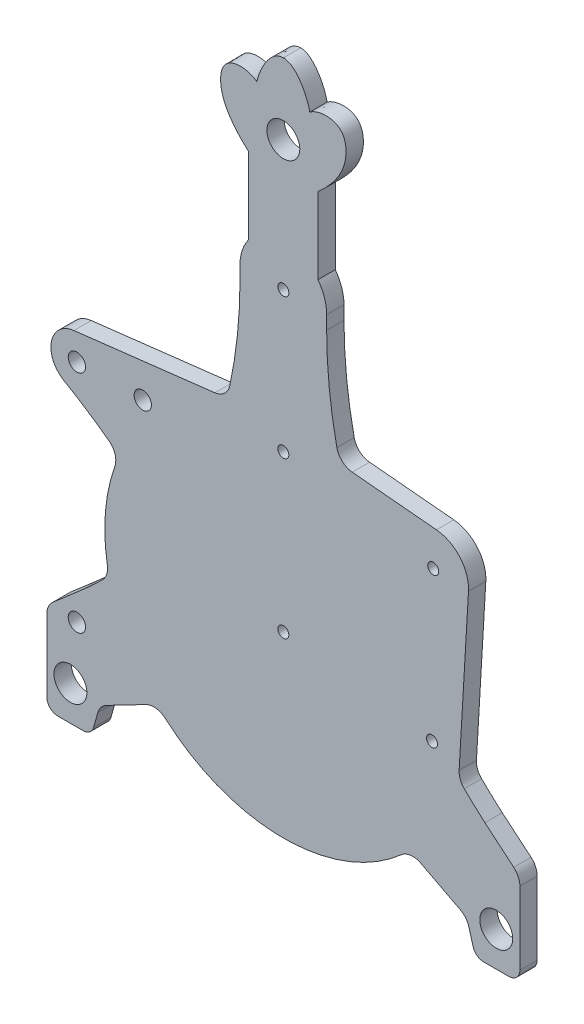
ISO-10303-21;
HEADER;
FILE_DESCRIPTION(('STEP AP214'),'2;1');
FILE_NAME('part.step','',(''),(''),'','','');
FILE_SCHEMA(('AUTOMOTIVE_DESIGN { 1 0 10303 214 1 1 1 1 }'));
ENDSEC;
DATA;
#1=APPLICATION_CONTEXT('core data for automotive mechanical design processes');
#2=APPLICATION_PROTOCOL_DEFINITION('international standard','automotive_design',2000,#1);
#3=PRODUCT_CONTEXT('',#1,'mechanical');
#4=PRODUCT('Part','Part','',(#3));
#5=PRODUCT_RELATED_PRODUCT_CATEGORY('part','',(#4));
#6=PRODUCT_DEFINITION_FORMATION('','',#4);
#7=PRODUCT_DEFINITION_CONTEXT('part definition',#1,'design');
#8=PRODUCT_DEFINITION('design','',#6,#7);
#9=PRODUCT_DEFINITION_SHAPE('','',#8);
#10=(LENGTH_UNIT() NAMED_UNIT(*) SI_UNIT(.MILLI.,.METRE.));
#11=(NAMED_UNIT(*) PLANE_ANGLE_UNIT() SI_UNIT($,.RADIAN.));
#12=(NAMED_UNIT(*) SI_UNIT($,.STERADIAN.) SOLID_ANGLE_UNIT());
#13=UNCERTAINTY_MEASURE_WITH_UNIT(LENGTH_MEASURE(1.E-05),#10,'distance_accuracy_value','');
#14=(GEOMETRIC_REPRESENTATION_CONTEXT(3) GLOBAL_UNCERTAINTY_ASSIGNED_CONTEXT((#13)) GLOBAL_UNIT_ASSIGNED_CONTEXT((#10,
#11,#12)) REPRESENTATION_CONTEXT('',''));
#15=CARTESIAN_POINT('',(0.,0.,0.));
#16=DIRECTION('',(0.,0.,1.));
#17=DIRECTION('',(1.,0.,0.));
#18=AXIS2_PLACEMENT_3D('',#15,#16,#17);
#19=CARTESIAN_POINT('',(126.5,-58.792277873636,10.));
#20=DIRECTION('',(0.,0.,-1.));
#21=DIRECTION('',(-1.,0.,0.));
#22=AXIS2_PLACEMENT_3D('',#19,#20,#21);
#23=PLANE('',#22);
#24=CARTESIAN_POINT('',(0.,171.,10.));
#25=DIRECTION('',(0.,0.,1.));
#26=DIRECTION('',(1.,0.,0.));
#27=AXIS2_PLACEMENT_3D('',#24,#25,#26);
#28=CIRCLE('',#27,3.175);
#29=CARTESIAN_POINT('',(3.175,171.,10.));
#30=VERTEX_POINT('',#29);
#31=EDGE_CURVE('E969',#30,#30,#28,.T.);
#32=ORIENTED_EDGE('',*,*,#31,.F.);
#33=EDGE_LOOP('',(#32));
#34=FACE_BOUND('',#33,.T.);
#35=CARTESIAN_POINT('',(86.492,74.9011942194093,10.));
#36=DIRECTION('',(0.,0.,1.));
#37=DIRECTION('',(1.,0.,0.));
#38=AXIS2_PLACEMENT_3D('',#35,#36,#37);
#39=CIRCLE('',#38,3.175);
#40=CARTESIAN_POINT('',(89.667,74.9011942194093,10.));
#41=VERTEX_POINT('',#40);
#42=EDGE_CURVE('E957',#41,#41,#39,.T.);
#43=ORIENTED_EDGE('',*,*,#42,.F.);
#44=EDGE_LOOP('',(#43));
#45=FACE_BOUND('',#44,.T.);
#46=CARTESIAN_POINT('',(0.,0.,10.));
#47=DIRECTION('',(0.,0.,1.));
#48=DIRECTION('',(1.,0.,0.));
#49=AXIS2_PLACEMENT_3D('',#46,#47,#48);
#50=CIRCLE('',#49,3.175);
#51=CARTESIAN_POINT('',(3.175,0.,10.));
#52=VERTEX_POINT('',#51);
#53=EDGE_CURVE('E945',#52,#52,#50,.T.);
#54=ORIENTED_EDGE('',*,*,#53,.F.);
#55=EDGE_LOOP('',(#54));
#56=FACE_BOUND('',#55,.T.);
#57=CARTESIAN_POINT('',(-119.12,75.28,10.));
#58=DIRECTION('',(0.,0.,1.));
#59=DIRECTION('',(1.,0.,0.));
#60=AXIS2_PLACEMENT_3D('',#57,#58,#59);
#61=CIRCLE('',#60,5.00000000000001);
#62=CARTESIAN_POINT('',(-114.12,75.28,10.));
#63=VERTEX_POINT('',#62);
#64=EDGE_CURVE('E933',#63,#63,#61,.T.);
#65=ORIENTED_EDGE('',*,*,#64,.F.);
#66=EDGE_LOOP('',(#65));
#67=FACE_BOUND('',#66,.T.);
#68=CARTESIAN_POINT('',(122.85,-87.13,10.));
#69=DIRECTION('',(0.,0.,1.));
#70=DIRECTION('',(1.,0.,0.));
#71=AXIS2_PLACEMENT_3D('',#68,#69,#70);
#72=CIRCLE('',#71,9.50000000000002);
#73=CARTESIAN_POINT('',(132.35,-87.13,10.));
#74=VERTEX_POINT('',#73);
#75=EDGE_CURVE('E921',#74,#74,#72,.T.);
#76=ORIENTED_EDGE('',*,*,#75,.F.);
#77=EDGE_LOOP('',(#76));
#78=FACE_BOUND('',#77,.T.);
#79=CARTESIAN_POINT('',(126.5,-58.792277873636,10.));
#80=DIRECTION('',(0.,0.,1.));
#81=DIRECTION('',(-1.,0.,0.));
#82=AXIS2_PLACEMENT_3D('',#79,#80,#81);
#83=CIRCLE('',#82,10.);
#84=CARTESIAN_POINT('',(136.5,-58.792277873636,10.));
#85=VERTEX_POINT('',#84);
#86=CARTESIAN_POINT('',(132.928881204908,-51.1326769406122,10.));
#87=VERTEX_POINT('',#86);
#88=EDGE_CURVE('E475',#85,#87,#83,.T.);
#89=ORIENTED_EDGE('',*,*,#88,.T.);
#90=DIRECTION('',(-0.765960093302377,0.642888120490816,0.));
#91=VECTOR('',#90,1.);
#92=CARTESIAN_POINT('',(132.928881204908,-51.1326769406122,10.));
#93=LINE('',#92,#91);
#94=CARTESIAN_POINT('',(116.326646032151,-37.1980348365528,10.));
#95=VERTEX_POINT('',#94);
#96=EDGE_CURVE('E208',#87,#95,#93,.T.);
#97=ORIENTED_EDGE('',*,*,#96,.T.);
#98=CARTESIAN_POINT('',(290.53,163.2,10.));
#99=DIRECTION('',(0.,0.,-1.));
#100=DIRECTION('',(1.,0.,0.));
#101=AXIS2_PLACEMENT_3D('',#98,#99,#100);
#102=CIRCLE('',#101,265.53);
#103=CARTESIAN_POINT('',(104.406274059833,-26.1782974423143,10.));
#104=VERTEX_POINT('',#103);
#105=EDGE_CURVE('E607',#95,#104,#102,.T.);
#106=ORIENTED_EDGE('',*,*,#105,.T.);
#107=CARTESIAN_POINT('',(111.415791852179,-19.0462107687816,10.));
#108=DIRECTION('',(0.,0.,-1.));
#109=DIRECTION('',(-1.,0.,0.));
#110=AXIS2_PLACEMENT_3D('',#107,#108,#109);
#111=CIRCLE('',#110,10.);
#112=CARTESIAN_POINT('',(101.432936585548,-18.4608897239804,10.));
#113=VERTEX_POINT('',#112);
#114=EDGE_CURVE('E626',#104,#113,#111,.T.);
#115=ORIENTED_EDGE('',*,*,#114,.T.);
#116=DIRECTION('',(0.0585321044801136,0.998285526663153,0.));
#117=VECTOR('',#116,1.);
#118=CARTESIAN_POINT('',(101.432936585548,-18.4608897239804,10.));
#119=LINE('',#118,#117);
#120=CARTESIAN_POINT('',(106.837059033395,73.7083099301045,10.));
#121=VERTEX_POINT('',#120);
#122=EDGE_CURVE('E623',#113,#121,#119,.T.);
#123=ORIENTED_EDGE('',*,*,#122,.T.);
#124=CARTESIAN_POINT('',(86.492,74.9011942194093,10.));
#125=DIRECTION('',(0.,0.,1.));
#126=DIRECTION('',(1.,0.,0.));
#127=AXIS2_PLACEMENT_3D('',#124,#125,#126);
#128=CIRCLE('',#127,20.38);
#129=CARTESIAN_POINT('',(88.374512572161,95.194063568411,10.));
#130=VERTEX_POINT('',#129);
#131=EDGE_CURVE('E625',#121,#130,#128,.T.);
#132=ORIENTED_EDGE('',*,*,#131,.T.);
#133=DIRECTION('',(-0.995724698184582,0.0923705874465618,0.));
#134=VECTOR('',#133,1.);
#135=CARTESIAN_POINT('',(39.7477474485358,99.7050321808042,10.));
#136=LINE('',#135,#134);
#137=CARTESIAN_POINT('',(39.7477474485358,99.7050321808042,10.));
#138=VERTEX_POINT('',#137);
#139=EDGE_CURVE('E628',#130,#138,#136,.T.);
#140=ORIENTED_EDGE('',*,*,#139,.T.);
#141=CARTESIAN_POINT('',(40.6714533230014,109.66227916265,10.));
#142=DIRECTION('',(0.,0.,-1.));
#143=DIRECTION('',(1.,0.,0.));
#144=AXIS2_PLACEMENT_3D('',#141,#142,#143);
#145=CIRCLE('',#144,10.);
#146=CARTESIAN_POINT('',(30.8934019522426,107.567115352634,10.));
#147=VERTEX_POINT('',#146);
#148=EDGE_CURVE('E634',#138,#147,#145,.T.);
#149=ORIENTED_EDGE('',*,*,#148,.T.);
#150=CARTESIAN_POINT('',(290.53,163.2,10.));
#151=DIRECTION('',(0.,0.,-1.));
#152=DIRECTION('',(1.,0.,0.));
#153=AXIS2_PLACEMENT_3D('',#150,#151,#152);
#154=CIRCLE('',#153,265.53);
#155=CARTESIAN_POINT('',(25.0000000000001,163.2,10.));
#156=VERTEX_POINT('',#155);
#157=EDGE_CURVE('E636',#147,#156,#154,.T.);
#158=ORIENTED_EDGE('',*,*,#157,.T.);
#159=DIRECTION('',(0.,1.,0.));
#160=VECTOR('',#159,1.);
#161=CARTESIAN_POINT('',(25.,171.,10.));
#162=LINE('',#161,#160);
#163=CARTESIAN_POINT('',(25.,171.,10.));
#164=VERTEX_POINT('',#163);
#165=EDGE_CURVE('E638',#156,#164,#162,.T.);
#166=ORIENTED_EDGE('',*,*,#165,.T.);
#167=CARTESIAN_POINT('',(0.,171.,10.));
#168=DIRECTION('',(0.,0.,1.));
#169=DIRECTION('',(1.,0.,0.));
#170=AXIS2_PLACEMENT_3D('',#167,#168,#169);
#171=CIRCLE('',#170,25.);
#172=CARTESIAN_POINT('',(20.,186.,10.));
#173=VERTEX_POINT('',#172);
#174=EDGE_CURVE('E640',#164,#173,#171,.T.);
#175=ORIENTED_EDGE('',*,*,#174,.T.);
#176=DIRECTION('',(0.,1.,0.));
#177=VECTOR('',#176,1.);
#178=CARTESIAN_POINT('',(20.,230.002,10.));
#179=LINE('',#178,#177);
#180=CARTESIAN_POINT('',(20.,230.002,10.));
#181=VERTEX_POINT('',#180);
#182=EDGE_CURVE('E642',#173,#181,#179,.T.);
#183=ORIENTED_EDGE('',*,*,#182,.T.);
#184=CARTESIAN_POINT('',(20.0000000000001,230.002,10.));
#185=CARTESIAN_POINT('',(27.7730009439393,236.866062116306,10.));
#186=CARTESIAN_POINT('',(38.2515897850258,249.058267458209,10.));
#187=CARTESIAN_POINT('',(35.5231616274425,265.096664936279,10.));
#188=CARTESIAN_POINT('',(28.3244984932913,271.683289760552,10.));
#189=CARTESIAN_POINT('',(19.1958894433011,270.473460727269,10.));
#190=CARTESIAN_POINT('',(15.24,267.326,10.));
#191=B_SPLINE_CURVE_WITH_KNOTS('',3,(#184,#185,#186,#187,#188,#189,#190),.UNSPECIFIED.,.F.,.F.,
(4,1,1,1,4),(0.,0.531917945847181,0.687311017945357,0.734119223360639,1.),.UNSPECIFIED.);
#192=CARTESIAN_POINT('',(15.24,267.326,10.));
#193=VERTEX_POINT('',#192);
#194=EDGE_CURVE('E644',#181,#193,#191,.T.);
#195=ORIENTED_EDGE('',*,*,#194,.T.);
#196=CARTESIAN_POINT('',(15.24,267.326,10.));
#197=CARTESIAN_POINT('',(14.9128408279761,270.825696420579,10.));
#198=CARTESIAN_POINT('',(8.94198980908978,286.87,10.));
#199=CARTESIAN_POINT('',(0.,286.87,10.));
#200=B_SPLINE_CURVE_WITH_KNOTS('',3,(#196,#197,#198,#199),.UNSPECIFIED.,.F.,.F.,(4,4),(0.,1.),.UNSPECIFIED.);
#201=CARTESIAN_POINT('',(0.,286.87,10.));
#202=VERTEX_POINT('',#201);
#203=EDGE_CURVE('E649',#193,#202,#200,.T.);
#204=ORIENTED_EDGE('',*,*,#203,.T.);
#205=CARTESIAN_POINT('',(0.,286.87,10.));
#206=CARTESIAN_POINT('',(-8.94198980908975,286.87,10.));
#207=CARTESIAN_POINT('',(-14.912840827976,270.825696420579,10.));
#208=CARTESIAN_POINT('',(-15.24,267.326,10.));
#209=B_SPLINE_CURVE_WITH_KNOTS('',3,(#205,#206,#207,#208),.UNSPECIFIED.,.F.,.F.,(4,4),(0.,1.),.UNSPECIFIED.);
#210=CARTESIAN_POINT('',(-15.24,267.326,10.));
#211=VERTEX_POINT('',#210);
#212=EDGE_CURVE('E848',#202,#211,#209,.T.);
#213=ORIENTED_EDGE('',*,*,#212,.T.);
#214=CARTESIAN_POINT('',(-15.24,267.326,10.));
#215=CARTESIAN_POINT('',(-19.1958894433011,270.473460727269,10.));
#216=CARTESIAN_POINT('',(-28.3244984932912,271.683289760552,10.));
#217=CARTESIAN_POINT('',(-35.5231616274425,265.096664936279,10.));
#218=CARTESIAN_POINT('',(-38.2515897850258,249.058267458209,10.));
#219=CARTESIAN_POINT('',(-27.7730009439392,236.866062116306,10.));
#220=CARTESIAN_POINT('',(-20.,230.002,10.));
#221=B_SPLINE_CURVE_WITH_KNOTS('',3,(#214,#215,#216,#217,#218,#219,#220),.UNSPECIFIED.,.F.,.F.,
(4,1,1,1,4),(0.,0.265880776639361,0.312688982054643,0.468082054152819,1.),.UNSPECIFIED.);
#222=CARTESIAN_POINT('',(-20.,230.002,10.));
#223=VERTEX_POINT('',#222);
#224=EDGE_CURVE('E842',#211,#223,#221,.T.);
#225=ORIENTED_EDGE('',*,*,#224,.T.);
#226=DIRECTION('',(0.,-1.,0.));
#227=VECTOR('',#226,1.);
#228=CARTESIAN_POINT('',(-20.0000000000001,230.002,10.));
#229=LINE('',#228,#227);
#230=CARTESIAN_POINT('',(-20.0000000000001,186.,10.));
#231=VERTEX_POINT('',#230);
#232=EDGE_CURVE('E847',#223,#231,#229,.T.);
#233=ORIENTED_EDGE('',*,*,#232,.T.);
#234=CARTESIAN_POINT('',(0.,171.,10.));
#235=DIRECTION('',(0.,0.,1.));
#236=DIRECTION('',(1.,0.,0.));
#237=AXIS2_PLACEMENT_3D('',#234,#235,#236);
#238=CIRCLE('',#237,25.0000000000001);
#239=CARTESIAN_POINT('',(-25.,171.,10.));
#240=VERTEX_POINT('',#239);
#241=EDGE_CURVE('E856',#231,#240,#238,.T.);
#242=ORIENTED_EDGE('',*,*,#241,.T.);
#243=DIRECTION('',(0.,-1.,0.));
#244=VECTOR('',#243,1.);
#245=CARTESIAN_POINT('',(-25.0000000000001,171.,10.));
#246=LINE('',#245,#244);
#247=CARTESIAN_POINT('',(-25.,163.2,10.));
#248=VERTEX_POINT('',#247);
#249=EDGE_CURVE('E858',#240,#248,#246,.T.);
#250=ORIENTED_EDGE('',*,*,#249,.T.);
#251=CARTESIAN_POINT('',(-290.53,163.2,10.));
#252=DIRECTION('',(0.,0.,-1.));
#253=DIRECTION('',(-1.,0.,0.));
#254=AXIS2_PLACEMENT_3D('',#251,#252,#253);
#255=CIRCLE('',#254,265.53);
#256=CARTESIAN_POINT('',(-30.8934019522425,107.567115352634,10.));
#257=VERTEX_POINT('',#256);
#258=EDGE_CURVE('E860',#248,#257,#255,.T.);
#259=ORIENTED_EDGE('',*,*,#258,.T.);
#260=CARTESIAN_POINT('',(-40.6714533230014,109.66227916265,10.));
#261=DIRECTION('',(0.,0.,-1.));
#262=DIRECTION('',(-1.,0.,0.));
#263=AXIS2_PLACEMENT_3D('',#260,#261,#262);
#264=CIRCLE('',#263,10.0000000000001);
#265=CARTESIAN_POINT('',(-39.5053738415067,99.7304989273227,10.));
#266=VERTEX_POINT('',#265);
#267=EDGE_CURVE('E862',#257,#266,#264,.T.);
#268=ORIENTED_EDGE('',*,*,#267,.T.);
#269=DIRECTION('',(-0.993178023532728,-0.11660794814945,0.));
#270=VECTOR('',#269,1.);
#271=CARTESIAN_POINT('',(-120.869119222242,90.1776703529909,10.));
#272=LINE('',#271,#270);
#273=CARTESIAN_POINT('',(-120.869119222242,90.1776703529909,10.));
#274=VERTEX_POINT('',#273);
#275=EDGE_CURVE('E864',#266,#274,#272,.T.);
#276=ORIENTED_EDGE('',*,*,#275,.T.);
#277=CARTESIAN_POINT('',(-119.12,75.28,10.));
#278=DIRECTION('',(0.,0.,1.));
#279=DIRECTION('',(1.,0.,0.));
#280=AXIS2_PLACEMENT_3D('',#277,#278,#279);
#281=CIRCLE('',#280,15.);
#282=CARTESIAN_POINT('',(-126.609079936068,62.2833203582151,10.));
#283=VERTEX_POINT('',#282);
#284=EDGE_CURVE('E866',#274,#283,#281,.T.);
#285=ORIENTED_EDGE('',*,*,#284,.T.);
#286=CARTESIAN_POINT('',(-259.180772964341,-167.783902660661,10.));
#287=DIRECTION('',(0.,0.,-1.));
#288=DIRECTION('',(1.,0.,0.));
#289=AXIS2_PLACEMENT_3D('',#286,#287,#288);
#290=CIRCLE('',#289,265.53);
#291=CARTESIAN_POINT('',(-99.6715028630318,44.4965101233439,10.));
#292=VERTEX_POINT('',#291);
#293=EDGE_CURVE('E868',#283,#292,#290,.T.);
#294=ORIENTED_EDGE('',*,*,#293,.T.);
#295=CARTESIAN_POINT('',(-106.680919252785,37.3643237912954,10.));
#296=DIRECTION('',(0.,0.,-1.));
#297=DIRECTION('',(1.,0.,0.));
#298=AXIS2_PLACEMENT_3D('',#295,#296,#297);
#299=CIRCLE('',#298,10.);
#300=CARTESIAN_POINT('',(-97.2430531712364,34.0587703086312,10.));
#301=VERTEX_POINT('',#300);
#302=EDGE_CURVE('E870',#292,#301,#299,.T.);
#303=ORIENTED_EDGE('',*,*,#302,.T.);
#304=CARTESIAN_POINT('',(0.,0.,10.));
#305=DIRECTION('',(0.,0.,1.));
#306=DIRECTION('',(1.,0.,0.));
#307=AXIS2_PLACEMENT_3D('',#304,#305,#306);
#308=CIRCLE('',#307,103.035);
#309=CARTESIAN_POINT('',(-101.561402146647,-17.3635485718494,10.));
#310=VERTEX_POINT('',#309);
#311=EDGE_CURVE('E872',#301,#310,#308,.T.);
#312=ORIENTED_EDGE('',*,*,#311,.T.);
#313=CARTESIAN_POINT('',(-111.418382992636,-19.048757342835,10.));
#314=DIRECTION('',(0.,0.,-1.));
#315=DIRECTION('',(-1.,0.,0.));
#316=AXIS2_PLACEMENT_3D('',#313,#314,#315);
#317=CIRCLE('',#316,10.);
#318=CARTESIAN_POINT('',(-104.408966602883,-26.1809436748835,10.));
#319=VERTEX_POINT('',#318);
#320=EDGE_CURVE('E874',#310,#319,#317,.T.);
#321=ORIENTED_EDGE('',*,*,#320,.T.);
#322=CARTESIAN_POINT('',(-290.53,163.2,10.));
#323=DIRECTION('',(0.,0.,-1.));
#324=DIRECTION('',(-1.,0.,0.));
#325=AXIS2_PLACEMENT_3D('',#322,#323,#324);
#326=CIRCLE('',#325,265.53);
#327=CARTESIAN_POINT('',(-116.326646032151,-37.1980348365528,10.));
#328=VERTEX_POINT('',#327);
#329=EDGE_CURVE('E876',#319,#328,#326,.T.);
#330=ORIENTED_EDGE('',*,*,#329,.T.);
#331=DIRECTION('',(-0.754709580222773,-0.656059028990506,0.));
#332=VECTOR('',#331,1.);
#333=CARTESIAN_POINT('',(-133.060590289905,-51.7446306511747,10.));
#334=LINE('',#333,#332);
#335=CARTESIAN_POINT('',(-133.060590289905,-51.7446306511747,10.));
#336=VERTEX_POINT('',#335);
#337=EDGE_CURVE('E878',#328,#336,#334,.T.);
#338=ORIENTED_EDGE('',*,*,#337,.T.);
#339=CARTESIAN_POINT('',(-126.5,-59.2917264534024,10.));
#340=DIRECTION('',(0.,0.,1.));
#341=DIRECTION('',(1.,0.,0.));
#342=AXIS2_PLACEMENT_3D('',#339,#340,#341);
#343=CIRCLE('',#342,10.);
#344=CARTESIAN_POINT('',(-136.5,-59.2917264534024,10.));
#345=VERTEX_POINT('',#344);
#346=EDGE_CURVE('E880',#336,#345,#343,.T.);
#347=ORIENTED_EDGE('',*,*,#346,.T.);
#348=DIRECTION('',(0.,-1.,0.));
#349=VECTOR('',#348,1.);
#350=CARTESIAN_POINT('',(-136.5,-100.78,10.));
#351=LINE('',#350,#349);
#352=CARTESIAN_POINT('',(-136.5,-100.78,10.));
#353=VERTEX_POINT('',#352);
#354=EDGE_CURVE('E882',#345,#353,#351,.T.);
#355=ORIENTED_EDGE('',*,*,#354,.T.);
#356=CARTESIAN_POINT('',(-130.15,-100.78,10.));
#357=DIRECTION('',(0.,0.,1.));
#358=DIRECTION('',(1.,0.,0.));
#359=AXIS2_PLACEMENT_3D('',#356,#357,#358);
#360=CIRCLE('',#359,6.34999999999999);
#361=CARTESIAN_POINT('',(-130.15,-107.13,10.));
#362=VERTEX_POINT('',#361);
#363=EDGE_CURVE('E884',#353,#362,#360,.T.);
#364=ORIENTED_EDGE('',*,*,#363,.T.);
#365=DIRECTION('',(1.,0.,0.));
#366=VECTOR('',#365,1.);
#367=CARTESIAN_POINT('',(-130.15,-107.13,10.));
#368=LINE('',#367,#366);
#369=CARTESIAN_POINT('',(-115.602467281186,-107.13,10.));
#370=VERTEX_POINT('',#369);
#371=EDGE_CURVE('E886',#362,#370,#368,.T.);
#372=ORIENTED_EDGE('',*,*,#371,.T.);
#373=CARTESIAN_POINT('',(-115.602467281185,-100.78,10.));
#374=DIRECTION('',(0.,0.,1.));
#375=DIRECTION('',(-1.,0.,0.));
#376=AXIS2_PLACEMENT_3D('',#373,#374,#375);
#377=CIRCLE('',#376,6.34999999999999);
#378=CARTESIAN_POINT('',(-109.492383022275,-102.508979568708,10.));
#379=VERTEX_POINT('',#378);
#380=EDGE_CURVE('E888',#370,#379,#377,.T.);
#381=ORIENTED_EDGE('',*,*,#380,.T.);
#382=DIRECTION('',(0.272280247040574,0.962217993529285,0.));
#383=VECTOR('',#382,1.);
#384=CARTESIAN_POINT('',(-109.492383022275,-102.508979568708,10.));
#385=LINE('',#384,#383);
#386=CARTESIAN_POINT('',(-107.054558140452,-93.8938890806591,10.));
#387=VERTEX_POINT('',#386);
#388=EDGE_CURVE('E890',#379,#387,#385,.T.);
#389=ORIENTED_EDGE('',*,*,#388,.T.);
#390=CARTESIAN_POINT('',(-97.4323782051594,-96.6166915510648,10.));
#391=DIRECTION('',(0.,0.,-1.));
#392=DIRECTION('',(1.,0.,0.));
#393=AXIS2_PLACEMENT_3D('',#390,#391,#392);
#394=CIRCLE('',#393,10.);
#395=CARTESIAN_POINT('',(-102.034376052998,-87.7385376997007,10.));
#396=VERTEX_POINT('',#395);
#397=EDGE_CURVE('E892',#387,#396,#394,.T.);
#398=ORIENTED_EDGE('',*,*,#397,.T.);
#399=DIRECTION('',(0.887815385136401,0.460199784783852,0.));
#400=VECTOR('',#399,1.);
#401=CARTESIAN_POINT('',(-102.034376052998,-87.7385376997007,10.));
#402=LINE('',#401,#400);
#403=CARTESIAN_POINT('',(-79.3025230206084,-75.9554642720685,10.));
#404=VERTEX_POINT('',#403);
#405=EDGE_CURVE('E894',#396,#404,#402,.T.);
#406=ORIENTED_EDGE('',*,*,#405,.T.);
#407=CARTESIAN_POINT('',(-74.7005251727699,-84.8336181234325,10.));
#408=DIRECTION('',(0.,0.,-1.));
#409=DIRECTION('',(-1.,0.,0.));
#410=AXIS2_PLACEMENT_3D('',#407,#408,#409);
#411=CIRCLE('',#410,10.);
#412=CARTESIAN_POINT('',(-68.0919061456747,-77.328542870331,10.));
#413=VERTEX_POINT('',#412);
#414=EDGE_CURVE('E896',#404,#413,#411,.T.);
#415=ORIENTED_EDGE('',*,*,#414,.T.);
#416=CARTESIAN_POINT('',(0.,0.,10.));
#417=DIRECTION('',(0.,0.,1.));
#418=DIRECTION('',(1.,0.,0.));
#419=AXIS2_PLACEMENT_3D('',#416,#417,#418);
#420=CIRCLE('',#419,103.035);
#421=CARTESIAN_POINT('',(68.0919061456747,-77.3285428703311,10.));
#422=VERTEX_POINT('',#421);
#423=EDGE_CURVE('E898',#413,#422,#420,.T.);
#424=ORIENTED_EDGE('',*,*,#423,.T.);
#425=CARTESIAN_POINT('',(74.7005251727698,-84.8336181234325,10.));
#426=DIRECTION('',(0.,0.,-1.));
#427=DIRECTION('',(1.,0.,0.));
#428=AXIS2_PLACEMENT_3D('',#425,#426,#427);
#429=CIRCLE('',#428,10.);
#430=CARTESIAN_POINT('',(79.3025230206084,-75.9554642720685,10.));
#431=VERTEX_POINT('',#430);
#432=EDGE_CURVE('E900',#422,#431,#429,.T.);
#433=ORIENTED_EDGE('',*,*,#432,.T.);
#434=DIRECTION('',(0.887815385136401,-0.460199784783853,0.));
#435=VECTOR('',#434,1.);
#436=CARTESIAN_POINT('',(102.034376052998,-87.7385376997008,10.));
#437=LINE('',#436,#435);
#438=CARTESIAN_POINT('',(102.034376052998,-87.7385376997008,10.));
#439=VERTEX_POINT('',#438);
#440=EDGE_CURVE('E902',#431,#439,#437,.T.);
#441=ORIENTED_EDGE('',*,*,#440,.T.);
#442=CARTESIAN_POINT('',(97.4323782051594,-96.6166915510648,10.));
#443=DIRECTION('',(0.,0.,-1.));
#444=DIRECTION('',(-1.,0.,0.));
#445=AXIS2_PLACEMENT_3D('',#442,#443,#444);
#446=CIRCLE('',#445,9.99999999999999);
#447=CARTESIAN_POINT('',(107.054558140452,-93.8938890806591,10.));
#448=VERTEX_POINT('',#447);
#449=EDGE_CURVE('E904',#439,#448,#446,.T.);
#450=ORIENTED_EDGE('',*,*,#449,.T.);
#451=DIRECTION('',(0.272280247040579,-0.962217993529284,0.));
#452=VECTOR('',#451,1.);
#453=CARTESIAN_POINT('',(109.492383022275,-102.508979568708,10.));
#454=LINE('',#453,#452);
#455=CARTESIAN_POINT('',(109.492383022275,-102.508979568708,10.));
#456=VERTEX_POINT('',#455);
#457=EDGE_CURVE('E906',#448,#456,#454,.T.);
#458=ORIENTED_EDGE('',*,*,#457,.T.);
#459=CARTESIAN_POINT('',(115.602467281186,-100.78,10.));
#460=DIRECTION('',(0.,0.,1.));
#461=DIRECTION('',(-1.,0.,0.));
#462=AXIS2_PLACEMENT_3D('',#459,#460,#461);
#463=CIRCLE('',#462,6.35);
#464=CARTESIAN_POINT('',(115.602467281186,-107.13,10.));
#465=VERTEX_POINT('',#464);
#466=EDGE_CURVE('E344',#456,#465,#463,.T.);
#467=ORIENTED_EDGE('',*,*,#466,.T.);
#468=DIRECTION('',(1.,0.,0.));
#469=VECTOR('',#468,1.);
#470=CARTESIAN_POINT('',(115.602467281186,-107.13,10.));
#471=LINE('',#470,#469);
#472=CARTESIAN_POINT('',(130.15,-107.13,10.));
#473=VERTEX_POINT('',#472);
#474=EDGE_CURVE('E338',#465,#473,#471,.T.);
#475=ORIENTED_EDGE('',*,*,#474,.T.);
#476=CARTESIAN_POINT('',(130.15,-100.78,10.));
#477=DIRECTION('',(0.,0.,1.));
#478=DIRECTION('',(1.,0.,0.));
#479=AXIS2_PLACEMENT_3D('',#476,#477,#478);
#480=CIRCLE('',#479,6.34999999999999);
#481=CARTESIAN_POINT('',(136.5,-100.78,10.));
#482=VERTEX_POINT('',#481);
#483=EDGE_CURVE('E342',#473,#482,#480,.T.);
#484=ORIENTED_EDGE('',*,*,#483,.T.);
#485=DIRECTION('',(0.,1.,0.));
#486=VECTOR('',#485,1.);
#487=CARTESIAN_POINT('',(136.5,-100.78,10.));
#488=LINE('',#487,#486);
#489=EDGE_CURVE('E48',#482,#85,#488,.T.);
#490=ORIENTED_EDGE('',*,*,#489,.T.);
#491=EDGE_LOOP('',(#89,#97,#106,#115,#123,#132,#140,#149,#158,#166,#175,#183,#195,#204,#213,
#225,#233,#242,#250,#259,#268,#276,#285,#294,#303,#312,#321,#330,#338,#347,#355,#364,#372,#381,
#389,#398,#406,#415,#424,#433,#441,#450,#458,#467,#475,#484,#490));
#492=FACE_BOUND('',#491,.T.);
#493=CARTESIAN_POINT('',(-122.85,-87.13,10.));
#494=DIRECTION('',(0.,0.,1.));
#495=DIRECTION('',(1.,0.,0.));
#496=AXIS2_PLACEMENT_3D('',#493,#494,#495);
#497=CIRCLE('',#496,9.50000000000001);
#498=CARTESIAN_POINT('',(-113.35,-87.13,10.));
#499=VERTEX_POINT('',#498);
#500=EDGE_CURVE('E366',#499,#499,#497,.T.);
#501=ORIENTED_EDGE('',*,*,#500,.F.);
#502=EDGE_LOOP('',(#501));
#503=FACE_BOUND('',#502,.T.);
#504=CARTESIAN_POINT('',(-119.12,-54.72,10.));
#505=DIRECTION('',(0.,0.,1.));
#506=DIRECTION('',(1.,0.,0.));
#507=AXIS2_PLACEMENT_3D('',#504,#505,#506);
#508=CIRCLE('',#507,5.00000000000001);
#509=CARTESIAN_POINT('',(-114.12,-54.72,10.));
#510=VERTEX_POINT('',#509);
#511=EDGE_CURVE('E927',#510,#510,#508,.T.);
#512=ORIENTED_EDGE('',*,*,#511,.F.);
#513=EDGE_LOOP('',(#512));
#514=FACE_BOUND('',#513,.T.);
#515=CARTESIAN_POINT('',(-81.12,75.28,10.));
#516=DIRECTION('',(0.,0.,1.));
#517=DIRECTION('',(1.,0.,0.));
#518=AXIS2_PLACEMENT_3D('',#515,#516,#517);
#519=CIRCLE('',#518,5.00000000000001);
#520=CARTESIAN_POINT('',(-76.1199999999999,75.28,10.));
#521=VERTEX_POINT('',#520);
#522=EDGE_CURVE('E939',#521,#521,#519,.T.);
#523=ORIENTED_EDGE('',*,*,#522,.F.);
#524=EDGE_LOOP('',(#523));
#525=FACE_BOUND('',#524,.T.);
#526=CARTESIAN_POINT('',(0.,90.,10.));
#527=DIRECTION('',(0.,0.,1.));
#528=DIRECTION('',(1.,0.,0.));
#529=AXIS2_PLACEMENT_3D('',#526,#527,#528);
#530=CIRCLE('',#529,3.175);
#531=CARTESIAN_POINT('',(3.175,90.,10.));
#532=VERTEX_POINT('',#531);
#533=EDGE_CURVE('E951',#532,#532,#530,.T.);
#534=ORIENTED_EDGE('',*,*,#533,.F.);
#535=EDGE_LOOP('',(#534));
#536=FACE_BOUND('',#535,.T.);
#537=CARTESIAN_POINT('',(85.8065347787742,-11.6960929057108,10.));
#538=DIRECTION('',(0.,0.,1.));
#539=DIRECTION('',(1.,0.,0.));
#540=AXIS2_PLACEMENT_3D('',#537,#538,#539);
#541=CIRCLE('',#540,3.175);
#542=CARTESIAN_POINT('',(88.9815347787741,-11.6960929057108,10.));
#543=VERTEX_POINT('',#542);
#544=EDGE_CURVE('E963',#543,#543,#541,.T.);
#545=ORIENTED_EDGE('',*,*,#544,.F.);
#546=EDGE_LOOP('',(#545));
#547=FACE_BOUND('',#546,.T.);
#548=CARTESIAN_POINT('',(0.,246.,10.));
#549=DIRECTION('',(0.,0.,1.));
#550=DIRECTION('',(1.,0.,0.));
#551=AXIS2_PLACEMENT_3D('',#548,#549,#550);
#552=CIRCLE('',#551,9.50000000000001);
#553=CARTESIAN_POINT('',(9.49999999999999,246.,10.));
#554=VERTEX_POINT('',#553);
#555=EDGE_CURVE('E975',#554,#554,#552,.T.);
#556=ORIENTED_EDGE('',*,*,#555,.F.);
#557=EDGE_LOOP('',(#556));
#558=FACE_BOUND('',#557,.T.);
#559=ADVANCED_FACE('F31',(#34,#45,#56,#67,#78,#492,#503,#514,#525,#536,#547,#558),#23,.F.);
#560=CARTESIAN_POINT('',(126.5,-58.792277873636,0.));
#561=DIRECTION('',(0.,0.,-1.));
#562=DIRECTION('',(-1.,0.,0.));
#563=AXIS2_PLACEMENT_3D('',#560,#561,#562);
#564=PLANE('',#563);
#565=CARTESIAN_POINT('',(0.,171.,0.));
#566=DIRECTION('',(0.,0.,1.));
#567=DIRECTION('',(1.,0.,0.));
#568=AXIS2_PLACEMENT_3D('',#565,#566,#567);
#569=CIRCLE('',#568,3.175);
#570=CARTESIAN_POINT('',(3.175,171.,0.));
#571=VERTEX_POINT('',#570);
#572=EDGE_CURVE('E972',#571,#571,#569,.T.);
#573=ORIENTED_EDGE('',*,*,#572,.T.);
#574=EDGE_LOOP('',(#573));
#575=FACE_BOUND('',#574,.T.);
#576=CARTESIAN_POINT('',(86.492,74.9011942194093,0.));
#577=DIRECTION('',(0.,0.,1.));
#578=DIRECTION('',(1.,0.,0.));
#579=AXIS2_PLACEMENT_3D('',#576,#577,#578);
#580=CIRCLE('',#579,3.175);
#581=CARTESIAN_POINT('',(89.667,74.9011942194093,0.));
#582=VERTEX_POINT('',#581);
#583=EDGE_CURVE('E960',#582,#582,#580,.T.);
#584=ORIENTED_EDGE('',*,*,#583,.T.);
#585=EDGE_LOOP('',(#584));
#586=FACE_BOUND('',#585,.T.);
#587=CARTESIAN_POINT('',(0.,0.,0.));
#588=DIRECTION('',(0.,0.,1.));
#589=DIRECTION('',(1.,0.,0.));
#590=AXIS2_PLACEMENT_3D('',#587,#588,#589);
#591=CIRCLE('',#590,3.175);
#592=CARTESIAN_POINT('',(3.175,0.,0.));
#593=VERTEX_POINT('',#592);
#594=EDGE_CURVE('E948',#593,#593,#591,.T.);
#595=ORIENTED_EDGE('',*,*,#594,.T.);
#596=EDGE_LOOP('',(#595));
#597=FACE_BOUND('',#596,.T.);
#598=CARTESIAN_POINT('',(-119.12,75.28,0.));
#599=DIRECTION('',(0.,0.,1.));
#600=DIRECTION('',(1.,0.,0.));
#601=AXIS2_PLACEMENT_3D('',#598,#599,#600);
#602=CIRCLE('',#601,5.00000000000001);
#603=CARTESIAN_POINT('',(-114.12,75.28,0.));
#604=VERTEX_POINT('',#603);
#605=EDGE_CURVE('E936',#604,#604,#602,.T.);
#606=ORIENTED_EDGE('',*,*,#605,.T.);
#607=EDGE_LOOP('',(#606));
#608=FACE_BOUND('',#607,.T.);
#609=CARTESIAN_POINT('',(122.85,-87.13,0.));
#610=DIRECTION('',(0.,0.,1.));
#611=DIRECTION('',(1.,0.,0.));
#612=AXIS2_PLACEMENT_3D('',#609,#610,#611);
#613=CIRCLE('',#612,9.50000000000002);
#614=CARTESIAN_POINT('',(132.35,-87.13,0.));
#615=VERTEX_POINT('',#614);
#616=EDGE_CURVE('E924',#615,#615,#613,.T.);
#617=ORIENTED_EDGE('',*,*,#616,.T.);
#618=EDGE_LOOP('',(#617));
#619=FACE_BOUND('',#618,.T.);
#620=CARTESIAN_POINT('',(126.5,-58.792277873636,0.));
#621=DIRECTION('',(0.,0.,1.));
#622=DIRECTION('',(-1.,0.,0.));
#623=AXIS2_PLACEMENT_3D('',#620,#621,#622);
#624=CIRCLE('',#623,10.);
#625=CARTESIAN_POINT('',(136.5,-58.792277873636,0.));
#626=VERTEX_POINT('',#625);
#627=CARTESIAN_POINT('',(132.928881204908,-51.1326769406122,0.));
#628=VERTEX_POINT('',#627);
#629=EDGE_CURVE('E362',#626,#628,#624,.T.);
#630=ORIENTED_EDGE('',*,*,#629,.F.);
#631=DIRECTION('',(0.,1.,0.));
#632=VECTOR('',#631,1.);
#633=CARTESIAN_POINT('',(136.5,-100.78,0.));
#634=LINE('',#633,#632);
#635=CARTESIAN_POINT('',(136.5,-100.78,0.));
#636=VERTEX_POINT('',#635);
#637=EDGE_CURVE('E200',#636,#626,#634,.T.);
#638=ORIENTED_EDGE('',*,*,#637,.F.);
#639=CARTESIAN_POINT('',(130.15,-100.78,0.));
#640=DIRECTION('',(0.,0.,1.));
#641=DIRECTION('',(1.,0.,0.));
#642=AXIS2_PLACEMENT_3D('',#639,#640,#641);
#643=CIRCLE('',#642,6.34999999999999);
#644=CARTESIAN_POINT('',(130.15,-107.13,0.));
#645=VERTEX_POINT('',#644);
#646=EDGE_CURVE('E194',#645,#636,#643,.T.);
#647=ORIENTED_EDGE('',*,*,#646,.F.);
#648=DIRECTION('',(1.,0.,0.));
#649=VECTOR('',#648,1.);
#650=CARTESIAN_POINT('',(115.602467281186,-107.13,0.));
#651=LINE('',#650,#649);
#652=CARTESIAN_POINT('',(115.602467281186,-107.13,0.));
#653=VERTEX_POINT('',#652);
#654=EDGE_CURVE('E352',#653,#645,#651,.T.);
#655=ORIENTED_EDGE('',*,*,#654,.F.);
#656=CARTESIAN_POINT('',(115.602467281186,-100.78,0.));
#657=DIRECTION('',(0.,0.,1.));
#658=DIRECTION('',(-1.,0.,0.));
#659=AXIS2_PLACEMENT_3D('',#656,#657,#658);
#660=CIRCLE('',#659,6.35);
#661=CARTESIAN_POINT('',(109.492383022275,-102.508979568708,0.));
#662=VERTEX_POINT('',#661);
#663=EDGE_CURVE('E470',#662,#653,#660,.T.);
#664=ORIENTED_EDGE('',*,*,#663,.F.);
#665=DIRECTION('',(0.272280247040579,-0.962217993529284,0.));
#666=VECTOR('',#665,1.);
#667=CARTESIAN_POINT('',(109.492383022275,-102.508979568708,0.));
#668=LINE('',#667,#666);
#669=CARTESIAN_POINT('',(107.054558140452,-93.8938890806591,0.));
#670=VERTEX_POINT('',#669);
#671=EDGE_CURVE('E468',#670,#662,#668,.T.);
#672=ORIENTED_EDGE('',*,*,#671,.F.);
#673=CARTESIAN_POINT('',(97.4323782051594,-96.6166915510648,0.));
#674=DIRECTION('',(0.,0.,-1.));
#675=DIRECTION('',(-1.,0.,0.));
#676=AXIS2_PLACEMENT_3D('',#673,#674,#675);
#677=CIRCLE('',#676,9.99999999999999);
#678=CARTESIAN_POINT('',(102.034376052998,-87.7385376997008,0.));
#679=VERTEX_POINT('',#678);
#680=EDGE_CURVE('E466',#679,#670,#677,.T.);
#681=ORIENTED_EDGE('',*,*,#680,.F.);
#682=DIRECTION('',(0.887815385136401,-0.460199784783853,0.));
#683=VECTOR('',#682,1.);
#684=CARTESIAN_POINT('',(102.034376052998,-87.7385376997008,0.));
#685=LINE('',#684,#683);
#686=CARTESIAN_POINT('',(79.3025230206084,-75.9554642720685,0.));
#687=VERTEX_POINT('',#686);
#688=EDGE_CURVE('E464',#687,#679,#685,.T.);
#689=ORIENTED_EDGE('',*,*,#688,.F.);
#690=CARTESIAN_POINT('',(74.7005251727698,-84.8336181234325,0.));
#691=DIRECTION('',(0.,0.,-1.));
#692=DIRECTION('',(1.,0.,0.));
#693=AXIS2_PLACEMENT_3D('',#690,#691,#692);
#694=CIRCLE('',#693,10.);
#695=CARTESIAN_POINT('',(68.0919061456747,-77.3285428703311,0.));
#696=VERTEX_POINT('',#695);
#697=EDGE_CURVE('E462',#696,#687,#694,.T.);
#698=ORIENTED_EDGE('',*,*,#697,.F.);
#699=CARTESIAN_POINT('',(0.,0.,0.));
#700=DIRECTION('',(0.,0.,1.));
#701=DIRECTION('',(1.,0.,0.));
#702=AXIS2_PLACEMENT_3D('',#699,#700,#701);
#703=CIRCLE('',#702,103.035);
#704=CARTESIAN_POINT('',(-68.0919061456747,-77.328542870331,0.));
#705=VERTEX_POINT('',#704);
#706=EDGE_CURVE('E460',#705,#696,#703,.T.);
#707=ORIENTED_EDGE('',*,*,#706,.F.);
#708=CARTESIAN_POINT('',(-74.7005251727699,-84.8336181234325,0.));
#709=DIRECTION('',(0.,0.,-1.));
#710=DIRECTION('',(-1.,0.,0.));
#711=AXIS2_PLACEMENT_3D('',#708,#709,#710);
#712=CIRCLE('',#711,10.);
#713=CARTESIAN_POINT('',(-79.3025230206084,-75.9554642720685,0.));
#714=VERTEX_POINT('',#713);
#715=EDGE_CURVE('E458',#714,#705,#712,.T.);
#716=ORIENTED_EDGE('',*,*,#715,.F.);
#717=DIRECTION('',(0.887815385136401,0.460199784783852,0.));
#718=VECTOR('',#717,1.);
#719=CARTESIAN_POINT('',(-102.034376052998,-87.7385376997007,0.));
#720=LINE('',#719,#718);
#721=CARTESIAN_POINT('',(-102.034376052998,-87.7385376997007,0.));
#722=VERTEX_POINT('',#721);
#723=EDGE_CURVE('E456',#722,#714,#720,.T.);
#724=ORIENTED_EDGE('',*,*,#723,.F.);
#725=CARTESIAN_POINT('',(-97.4323782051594,-96.6166915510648,0.));
#726=DIRECTION('',(0.,0.,-1.));
#727=DIRECTION('',(1.,0.,0.));
#728=AXIS2_PLACEMENT_3D('',#725,#726,#727);
#729=CIRCLE('',#728,10.);
#730=CARTESIAN_POINT('',(-107.054558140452,-93.8938890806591,0.));
#731=VERTEX_POINT('',#730);
#732=EDGE_CURVE('E454',#731,#722,#729,.T.);
#733=ORIENTED_EDGE('',*,*,#732,.F.);
#734=DIRECTION('',(0.272280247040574,0.962217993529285,0.));
#735=VECTOR('',#734,1.);
#736=CARTESIAN_POINT('',(-109.492383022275,-102.508979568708,0.));
#737=LINE('',#736,#735);
#738=CARTESIAN_POINT('',(-109.492383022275,-102.508979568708,0.));
#739=VERTEX_POINT('',#738);
#740=EDGE_CURVE('E452',#739,#731,#737,.T.);
#741=ORIENTED_EDGE('',*,*,#740,.F.);
#742=CARTESIAN_POINT('',(-115.602467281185,-100.78,0.));
#743=DIRECTION('',(0.,0.,1.));
#744=DIRECTION('',(-1.,0.,0.));
#745=AXIS2_PLACEMENT_3D('',#742,#743,#744);
#746=CIRCLE('',#745,6.34999999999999);
#747=CARTESIAN_POINT('',(-115.602467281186,-107.13,0.));
#748=VERTEX_POINT('',#747);
#749=EDGE_CURVE('E450',#748,#739,#746,.T.);
#750=ORIENTED_EDGE('',*,*,#749,.F.);
#751=DIRECTION('',(1.,0.,0.));
#752=VECTOR('',#751,1.);
#753=CARTESIAN_POINT('',(-130.15,-107.13,0.));
#754=LINE('',#753,#752);
#755=CARTESIAN_POINT('',(-130.15,-107.13,0.));
#756=VERTEX_POINT('',#755);
#757=EDGE_CURVE('E448',#756,#748,#754,.T.);
#758=ORIENTED_EDGE('',*,*,#757,.F.);
#759=CARTESIAN_POINT('',(-130.15,-100.78,0.));
#760=DIRECTION('',(0.,0.,1.));
#761=DIRECTION('',(1.,0.,0.));
#762=AXIS2_PLACEMENT_3D('',#759,#760,#761);
#763=CIRCLE('',#762,6.34999999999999);
#764=CARTESIAN_POINT('',(-136.5,-100.78,0.));
#765=VERTEX_POINT('',#764);
#766=EDGE_CURVE('E446',#765,#756,#763,.T.);
#767=ORIENTED_EDGE('',*,*,#766,.F.);
#768=DIRECTION('',(0.,-1.,0.));
#769=VECTOR('',#768,1.);
#770=CARTESIAN_POINT('',(-136.5,-100.78,0.));
#771=LINE('',#770,#769);
#772=CARTESIAN_POINT('',(-136.5,-59.2917264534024,0.));
#773=VERTEX_POINT('',#772);
#774=EDGE_CURVE('E444',#773,#765,#771,.T.);
#775=ORIENTED_EDGE('',*,*,#774,.F.);
#776=CARTESIAN_POINT('',(-126.5,-59.2917264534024,0.));
#777=DIRECTION('',(0.,0.,1.));
#778=DIRECTION('',(1.,0.,0.));
#779=AXIS2_PLACEMENT_3D('',#776,#777,#778);
#780=CIRCLE('',#779,10.);
#781=CARTESIAN_POINT('',(-133.060590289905,-51.7446306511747,0.));
#782=VERTEX_POINT('',#781);
#783=EDGE_CURVE('E442',#782,#773,#780,.T.);
#784=ORIENTED_EDGE('',*,*,#783,.F.);
#785=DIRECTION('',(-0.754709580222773,-0.656059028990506,0.));
#786=VECTOR('',#785,1.);
#787=CARTESIAN_POINT('',(-133.060590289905,-51.7446306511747,0.));
#788=LINE('',#787,#786);
#789=CARTESIAN_POINT('',(-116.326646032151,-37.1980348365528,0.));
#790=VERTEX_POINT('',#789);
#791=EDGE_CURVE('E440',#790,#782,#788,.T.);
#792=ORIENTED_EDGE('',*,*,#791,.F.);
#793=CARTESIAN_POINT('',(-290.53,163.2,0.));
#794=DIRECTION('',(0.,0.,-1.));
#795=DIRECTION('',(-1.,0.,0.));
#796=AXIS2_PLACEMENT_3D('',#793,#794,#795);
#797=CIRCLE('',#796,265.53);
#798=CARTESIAN_POINT('',(-104.408966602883,-26.1809436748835,0.));
#799=VERTEX_POINT('',#798);
#800=EDGE_CURVE('E438',#799,#790,#797,.T.);
#801=ORIENTED_EDGE('',*,*,#800,.F.);
#802=CARTESIAN_POINT('',(-111.418382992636,-19.048757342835,0.));
#803=DIRECTION('',(0.,0.,-1.));
#804=DIRECTION('',(-1.,0.,0.));
#805=AXIS2_PLACEMENT_3D('',#802,#803,#804);
#806=CIRCLE('',#805,10.);
#807=CARTESIAN_POINT('',(-101.561402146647,-17.3635485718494,0.));
#808=VERTEX_POINT('',#807);
#809=EDGE_CURVE('E436',#808,#799,#806,.T.);
#810=ORIENTED_EDGE('',*,*,#809,.F.);
#811=CARTESIAN_POINT('',(0.,0.,0.));
#812=DIRECTION('',(0.,0.,1.));
#813=DIRECTION('',(1.,0.,0.));
#814=AXIS2_PLACEMENT_3D('',#811,#812,#813);
#815=CIRCLE('',#814,103.035);
#816=CARTESIAN_POINT('',(-97.2430531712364,34.0587703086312,0.));
#817=VERTEX_POINT('',#816);
#818=EDGE_CURVE('E434',#817,#808,#815,.T.);
#819=ORIENTED_EDGE('',*,*,#818,.F.);
#820=CARTESIAN_POINT('',(-106.680919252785,37.3643237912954,0.));
#821=DIRECTION('',(0.,0.,-1.));
#822=DIRECTION('',(1.,0.,0.));
#823=AXIS2_PLACEMENT_3D('',#820,#821,#822);
#824=CIRCLE('',#823,10.);
#825=CARTESIAN_POINT('',(-99.6715028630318,44.4965101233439,0.));
#826=VERTEX_POINT('',#825);
#827=EDGE_CURVE('E432',#826,#817,#824,.T.);
#828=ORIENTED_EDGE('',*,*,#827,.F.);
#829=CARTESIAN_POINT('',(-259.180772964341,-167.783902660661,0.));
#830=DIRECTION('',(0.,0.,-1.));
#831=DIRECTION('',(1.,0.,0.));
#832=AXIS2_PLACEMENT_3D('',#829,#830,#831);
#833=CIRCLE('',#832,265.53);
#834=CARTESIAN_POINT('',(-126.609079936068,62.2833203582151,0.));
#835=VERTEX_POINT('',#834);
#836=EDGE_CURVE('E430',#835,#826,#833,.T.);
#837=ORIENTED_EDGE('',*,*,#836,.F.);
#838=CARTESIAN_POINT('',(-119.12,75.28,0.));
#839=DIRECTION('',(0.,0.,1.));
#840=DIRECTION('',(1.,0.,0.));
#841=AXIS2_PLACEMENT_3D('',#838,#839,#840);
#842=CIRCLE('',#841,15.);
#843=CARTESIAN_POINT('',(-120.869119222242,90.1776703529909,0.));
#844=VERTEX_POINT('',#843);
#845=EDGE_CURVE('E428',#844,#835,#842,.T.);
#846=ORIENTED_EDGE('',*,*,#845,.F.);
#847=DIRECTION('',(-0.993178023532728,-0.11660794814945,0.));
#848=VECTOR('',#847,1.);
#849=CARTESIAN_POINT('',(-120.869119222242,90.1776703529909,0.));
#850=LINE('',#849,#848);
#851=CARTESIAN_POINT('',(-39.5053738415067,99.7304989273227,0.));
#852=VERTEX_POINT('',#851);
#853=EDGE_CURVE('E426',#852,#844,#850,.T.);
#854=ORIENTED_EDGE('',*,*,#853,.F.);
#855=CARTESIAN_POINT('',(-40.6714533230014,109.66227916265,0.));
#856=DIRECTION('',(0.,0.,-1.));
#857=DIRECTION('',(-1.,0.,0.));
#858=AXIS2_PLACEMENT_3D('',#855,#856,#857);
#859=CIRCLE('',#858,10.0000000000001);
#860=CARTESIAN_POINT('',(-30.8934019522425,107.567115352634,0.));
#861=VERTEX_POINT('',#860);
#862=EDGE_CURVE('E424',#861,#852,#859,.T.);
#863=ORIENTED_EDGE('',*,*,#862,.F.);
#864=CARTESIAN_POINT('',(-290.53,163.2,0.));
#865=DIRECTION('',(0.,0.,-1.));
#866=DIRECTION('',(-1.,0.,0.));
#867=AXIS2_PLACEMENT_3D('',#864,#865,#866);
#868=CIRCLE('',#867,265.53);
#869=CARTESIAN_POINT('',(-25.,163.2,0.));
#870=VERTEX_POINT('',#869);
#871=EDGE_CURVE('E422',#870,#861,#868,.T.);
#872=ORIENTED_EDGE('',*,*,#871,.F.);
#873=DIRECTION('',(0.,-1.,0.));
#874=VECTOR('',#873,1.);
#875=CARTESIAN_POINT('',(-25.0000000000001,171.,0.));
#876=LINE('',#875,#874);
#877=CARTESIAN_POINT('',(-25.,171.,0.));
#878=VERTEX_POINT('',#877);
#879=EDGE_CURVE('E420',#878,#870,#876,.T.);
#880=ORIENTED_EDGE('',*,*,#879,.F.);
#881=CARTESIAN_POINT('',(0.,171.,0.));
#882=DIRECTION('',(0.,0.,1.));
#883=DIRECTION('',(1.,0.,0.));
#884=AXIS2_PLACEMENT_3D('',#881,#882,#883);
#885=CIRCLE('',#884,25.0000000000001);
#886=CARTESIAN_POINT('',(-20.0000000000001,186.,0.));
#887=VERTEX_POINT('',#886);
#888=EDGE_CURVE('E418',#887,#878,#885,.T.);
#889=ORIENTED_EDGE('',*,*,#888,.F.);
#890=DIRECTION('',(0.,-1.,0.));
#891=VECTOR('',#890,1.);
#892=CARTESIAN_POINT('',(-20.0000000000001,230.002,0.));
#893=LINE('',#892,#891);
#894=CARTESIAN_POINT('',(-20.,230.002,0.));
#895=VERTEX_POINT('',#894);
#896=EDGE_CURVE('E413',#895,#887,#893,.T.);
#897=ORIENTED_EDGE('',*,*,#896,.F.);
#898=CARTESIAN_POINT('',(-15.24,267.326,0.));
#899=CARTESIAN_POINT('',(-19.1958894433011,270.473460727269,0.));
#900=CARTESIAN_POINT('',(-28.3244984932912,271.683289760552,0.));
#901=CARTESIAN_POINT('',(-35.5231616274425,265.096664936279,0.));
#902=CARTESIAN_POINT('',(-38.2515897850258,249.058267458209,0.));
#903=CARTESIAN_POINT('',(-27.7730009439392,236.866062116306,0.));
#904=CARTESIAN_POINT('',(-20.,230.002,0.));
#905=B_SPLINE_CURVE_WITH_KNOTS('',3,(#898,#899,#900,#901,#902,#903,#904),.UNSPECIFIED.,.F.,.F.,
(4,1,1,1,4),(0.,0.265880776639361,0.312688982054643,0.468082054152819,1.),.UNSPECIFIED.);
#906=CARTESIAN_POINT('',(-15.24,267.326,0.));
#907=VERTEX_POINT('',#906);
#908=EDGE_CURVE('E406',#907,#895,#905,.T.);
#909=ORIENTED_EDGE('',*,*,#908,.F.);
#910=CARTESIAN_POINT('',(0.,286.87,0.));
#911=CARTESIAN_POINT('',(-8.94198980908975,286.87,0.));
#912=CARTESIAN_POINT('',(-14.912840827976,270.825696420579,0.));
#913=CARTESIAN_POINT('',(-15.24,267.326,0.));
#914=B_SPLINE_CURVE_WITH_KNOTS('',3,(#910,#911,#912,#913),.UNSPECIFIED.,.F.,.F.,(4,4),(0.,1.),.UNSPECIFIED.);
#915=CARTESIAN_POINT('',(0.,286.87,0.));
#916=VERTEX_POINT('',#915);
#917=EDGE_CURVE('E399',#916,#907,#914,.T.);
#918=ORIENTED_EDGE('',*,*,#917,.F.);
#919=CARTESIAN_POINT('',(15.24,267.326,0.));
#920=CARTESIAN_POINT('',(14.9128408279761,270.825696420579,0.));
#921=CARTESIAN_POINT('',(8.94198980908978,286.87,0.));
#922=CARTESIAN_POINT('',(0.,286.87,0.));
#923=B_SPLINE_CURVE_WITH_KNOTS('',3,(#919,#920,#921,#922),.UNSPECIFIED.,.F.,.F.,(4,4),(0.,1.),.UNSPECIFIED.);
#924=CARTESIAN_POINT('',(15.24,267.326,0.));
#925=VERTEX_POINT('',#924);
#926=EDGE_CURVE('E392',#925,#916,#923,.T.);
#927=ORIENTED_EDGE('',*,*,#926,.F.);
#928=CARTESIAN_POINT('',(20.0000000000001,230.002,0.));
#929=CARTESIAN_POINT('',(27.7730009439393,236.866062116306,0.));
#930=CARTESIAN_POINT('',(38.2515897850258,249.058267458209,0.));
#931=CARTESIAN_POINT('',(35.5231616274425,265.096664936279,0.));
#932=CARTESIAN_POINT('',(28.3244984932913,271.683289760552,0.));
#933=CARTESIAN_POINT('',(19.1958894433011,270.473460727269,0.));
#934=CARTESIAN_POINT('',(15.24,267.326,0.));
#935=B_SPLINE_CURVE_WITH_KNOTS('',3,(#928,#929,#930,#931,#932,#933,#934),.UNSPECIFIED.,.F.,.F.,
(4,1,1,1,4),(0.,0.531917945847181,0.687311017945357,0.734119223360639,1.),.UNSPECIFIED.);
#936=CARTESIAN_POINT('',(20.,230.002,0.));
#937=VERTEX_POINT('',#936);
#938=EDGE_CURVE('E388',#937,#925,#935,.T.);
#939=ORIENTED_EDGE('',*,*,#938,.F.);
#940=DIRECTION('',(0.,1.,0.));
#941=VECTOR('',#940,1.);
#942=CARTESIAN_POINT('',(20.,230.002,0.));
#943=LINE('',#942,#941);
#944=CARTESIAN_POINT('',(20.,186.,0.));
#945=VERTEX_POINT('',#944);
#946=EDGE_CURVE('E386',#945,#937,#943,.T.);
#947=ORIENTED_EDGE('',*,*,#946,.F.);
#948=CARTESIAN_POINT('',(0.,171.,0.));
#949=DIRECTION('',(0.,0.,1.));
#950=DIRECTION('',(1.,0.,0.));
#951=AXIS2_PLACEMENT_3D('',#948,#949,#950);
#952=CIRCLE('',#951,25.);
#953=CARTESIAN_POINT('',(25.,171.,0.));
#954=VERTEX_POINT('',#953);
#955=EDGE_CURVE('E384',#954,#945,#952,.T.);
#956=ORIENTED_EDGE('',*,*,#955,.F.);
#957=DIRECTION('',(0.,1.,0.));
#958=VECTOR('',#957,1.);
#959=CARTESIAN_POINT('',(25.,171.,0.));
#960=LINE('',#959,#958);
#961=CARTESIAN_POINT('',(25.0000000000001,163.2,0.));
#962=VERTEX_POINT('',#961);
#963=EDGE_CURVE('E382',#962,#954,#960,.T.);
#964=ORIENTED_EDGE('',*,*,#963,.F.);
#965=CARTESIAN_POINT('',(290.53,163.2,0.));
#966=DIRECTION('',(0.,0.,-1.));
#967=DIRECTION('',(1.,0.,0.));
#968=AXIS2_PLACEMENT_3D('',#965,#966,#967);
#969=CIRCLE('',#968,265.53);
#970=CARTESIAN_POINT('',(30.8934019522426,107.567115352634,0.));
#971=VERTEX_POINT('',#970);
#972=EDGE_CURVE('E380',#971,#962,#969,.T.);
#973=ORIENTED_EDGE('',*,*,#972,.F.);
#974=CARTESIAN_POINT('',(40.6714533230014,109.66227916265,0.));
#975=DIRECTION('',(0.,0.,-1.));
#976=DIRECTION('',(1.,0.,0.));
#977=AXIS2_PLACEMENT_3D('',#974,#975,#976);
#978=CIRCLE('',#977,10.);
#979=CARTESIAN_POINT('',(39.7477474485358,99.7050321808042,0.));
#980=VERTEX_POINT('',#979);
#981=EDGE_CURVE('E378',#980,#971,#978,.T.);
#982=ORIENTED_EDGE('',*,*,#981,.F.);
#983=DIRECTION('',(-0.995724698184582,0.0923705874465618,0.));
#984=VECTOR('',#983,1.);
#985=CARTESIAN_POINT('',(39.7477474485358,99.7050321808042,0.));
#986=LINE('',#985,#984);
#987=CARTESIAN_POINT('',(88.374512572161,95.194063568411,0.));
#988=VERTEX_POINT('',#987);
#989=EDGE_CURVE('E376',#988,#980,#986,.T.);
#990=ORIENTED_EDGE('',*,*,#989,.F.);
#991=CARTESIAN_POINT('',(86.492,74.9011942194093,0.));
#992=DIRECTION('',(0.,0.,1.));
#993=DIRECTION('',(1.,0.,0.));
#994=AXIS2_PLACEMENT_3D('',#991,#992,#993);
#995=CIRCLE('',#994,20.38);
#996=CARTESIAN_POINT('',(106.837059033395,73.7083099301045,0.));
#997=VERTEX_POINT('',#996);
#998=EDGE_CURVE('E374',#997,#988,#995,.T.);
#999=ORIENTED_EDGE('',*,*,#998,.F.);
#1000=DIRECTION('',(0.0585321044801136,0.998285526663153,0.));
#1001=VECTOR('',#1000,1.);
#1002=CARTESIAN_POINT('',(101.432936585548,-18.4608897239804,0.));
#1003=LINE('',#1002,#1001);
#1004=CARTESIAN_POINT('',(101.432936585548,-18.4608897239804,0.));
#1005=VERTEX_POINT('',#1004);
#1006=EDGE_CURVE('E372',#1005,#997,#1003,.T.);
#1007=ORIENTED_EDGE('',*,*,#1006,.F.);
#1008=CARTESIAN_POINT('',(111.415791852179,-19.0462107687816,0.));
#1009=DIRECTION('',(0.,0.,-1.));
#1010=DIRECTION('',(-1.,0.,0.));
#1011=AXIS2_PLACEMENT_3D('',#1008,#1009,#1010);
#1012=CIRCLE('',#1011,10.);
#1013=CARTESIAN_POINT('',(104.406274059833,-26.1782974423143,0.));
#1014=VERTEX_POINT('',#1013);
#1015=EDGE_CURVE('E370',#1014,#1005,#1012,.T.);
#1016=ORIENTED_EDGE('',*,*,#1015,.F.);
#1017=CARTESIAN_POINT('',(290.53,163.2,0.));
#1018=DIRECTION('',(0.,0.,-1.));
#1019=DIRECTION('',(1.,0.,0.));
#1020=AXIS2_PLACEMENT_3D('',#1017,#1018,#1019);
#1021=CIRCLE('',#1020,265.53);
#1022=CARTESIAN_POINT('',(116.326646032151,-37.1980348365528,0.));
#1023=VERTEX_POINT('',#1022);
#1024=EDGE_CURVE('E368',#1023,#1014,#1021,.T.);
#1025=ORIENTED_EDGE('',*,*,#1024,.F.);
#1026=DIRECTION('',(-0.765960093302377,0.642888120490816,0.));
#1027=VECTOR('',#1026,1.);
#1028=CARTESIAN_POINT('',(132.928881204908,-51.1326769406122,0.));
#1029=LINE('',#1028,#1027);
#1030=EDGE_CURVE('E365',#628,#1023,#1029,.T.);
#1031=ORIENTED_EDGE('',*,*,#1030,.F.);
#1032=EDGE_LOOP('',(#630,#638,#647,#655,#664,#672,#681,#689,#698,#707,#716,#724,#733,#741,#750,
#758,#767,#775,#784,#792,#801,#810,#819,#828,#837,#846,#854,#863,#872,#880,#889,#897,#909,#918,
#927,#939,#947,#956,#964,#973,#982,#990,#999,#1007,#1016,#1025,#1031));
#1033=FACE_BOUND('',#1032,.T.);
#1034=CARTESIAN_POINT('',(-122.85,-87.13,0.));
#1035=DIRECTION('',(0.,0.,1.));
#1036=DIRECTION('',(1.,0.,0.));
#1037=AXIS2_PLACEMENT_3D('',#1034,#1035,#1036);
#1038=CIRCLE('',#1037,9.50000000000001);
#1039=CARTESIAN_POINT('',(-113.35,-87.13,0.));
#1040=VERTEX_POINT('',#1039);
#1041=EDGE_CURVE('E918',#1040,#1040,#1038,.T.);
#1042=ORIENTED_EDGE('',*,*,#1041,.T.);
#1043=EDGE_LOOP('',(#1042));
#1044=FACE_BOUND('',#1043,.T.);
#1045=CARTESIAN_POINT('',(-119.12,-54.72,0.));
#1046=DIRECTION('',(0.,0.,1.));
#1047=DIRECTION('',(1.,0.,0.));
#1048=AXIS2_PLACEMENT_3D('',#1045,#1046,#1047);
#1049=CIRCLE('',#1048,5.00000000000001);
#1050=CARTESIAN_POINT('',(-114.12,-54.72,0.));
#1051=VERTEX_POINT('',#1050);
#1052=EDGE_CURVE('E930',#1051,#1051,#1049,.T.);
#1053=ORIENTED_EDGE('',*,*,#1052,.T.);
#1054=EDGE_LOOP('',(#1053));
#1055=FACE_BOUND('',#1054,.T.);
#1056=CARTESIAN_POINT('',(-81.12,75.28,0.));
#1057=DIRECTION('',(0.,0.,1.));
#1058=DIRECTION('',(1.,0.,0.));
#1059=AXIS2_PLACEMENT_3D('',#1056,#1057,#1058);
#1060=CIRCLE('',#1059,5.00000000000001);
#1061=CARTESIAN_POINT('',(-76.1199999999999,75.28,0.));
#1062=VERTEX_POINT('',#1061);
#1063=EDGE_CURVE('E942',#1062,#1062,#1060,.T.);
#1064=ORIENTED_EDGE('',*,*,#1063,.T.);
#1065=EDGE_LOOP('',(#1064));
#1066=FACE_BOUND('',#1065,.T.);
#1067=CARTESIAN_POINT('',(0.,90.,0.));
#1068=DIRECTION('',(0.,0.,1.));
#1069=DIRECTION('',(1.,0.,0.));
#1070=AXIS2_PLACEMENT_3D('',#1067,#1068,#1069);
#1071=CIRCLE('',#1070,3.175);
#1072=CARTESIAN_POINT('',(3.175,90.,0.));
#1073=VERTEX_POINT('',#1072);
#1074=EDGE_CURVE('E954',#1073,#1073,#1071,.T.);
#1075=ORIENTED_EDGE('',*,*,#1074,.T.);
#1076=EDGE_LOOP('',(#1075));
#1077=FACE_BOUND('',#1076,.T.);
#1078=CARTESIAN_POINT('',(85.8065347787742,-11.6960929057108,0.));
#1079=DIRECTION('',(0.,0.,1.));
#1080=DIRECTION('',(1.,0.,0.));
#1081=AXIS2_PLACEMENT_3D('',#1078,#1079,#1080);
#1082=CIRCLE('',#1081,3.175);
#1083=CARTESIAN_POINT('',(88.9815347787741,-11.6960929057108,0.));
#1084=VERTEX_POINT('',#1083);
#1085=EDGE_CURVE('E966',#1084,#1084,#1082,.T.);
#1086=ORIENTED_EDGE('',*,*,#1085,.T.);
#1087=EDGE_LOOP('',(#1086));
#1088=FACE_BOUND('',#1087,.T.);
#1089=CARTESIAN_POINT('',(0.,246.,0.));
#1090=DIRECTION('',(0.,0.,1.));
#1091=DIRECTION('',(1.,0.,0.));
#1092=AXIS2_PLACEMENT_3D('',#1089,#1090,#1091);
#1093=CIRCLE('',#1092,9.50000000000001);
#1094=CARTESIAN_POINT('',(9.49999999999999,246.,0.));
#1095=VERTEX_POINT('',#1094);
#1096=EDGE_CURVE('E978',#1095,#1095,#1093,.T.);
#1097=ORIENTED_EDGE('',*,*,#1096,.T.);
#1098=EDGE_LOOP('',(#1097));
#1099=FACE_BOUND('',#1098,.T.);
#1100=ADVANCED_FACE('F611',(#575,#586,#597,#608,#619,#1033,#1044,#1055,#1066,#1077,#1088,#1099),
#564,.T.);
#1101=CARTESIAN_POINT('',(126.5,-58.792277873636,10.));
#1102=DIRECTION('',(0.,0.,-1.));
#1103=DIRECTION('',(-1.,0.,0.));
#1104=AXIS2_PLACEMENT_3D('',#1101,#1102,#1103);
#1105=CYLINDRICAL_SURFACE('',#1104,10.);
#1106=ORIENTED_EDGE('',*,*,#629,.T.);
#1107=DIRECTION('',(0.,0.,-1.));
#1108=VECTOR('',#1107,1.);
#1109=CARTESIAN_POINT('',(132.928881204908,-51.1326769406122,10.));
#1110=LINE('',#1109,#1108);
#1111=EDGE_CURVE('E11',#87,#628,#1110,.T.);
#1112=ORIENTED_EDGE('',*,*,#1111,.F.);
#1113=ORIENTED_EDGE('',*,*,#88,.F.);
#1114=DIRECTION('',(0.,0.,-1.));
#1115=VECTOR('',#1114,1.);
#1116=CARTESIAN_POINT('',(136.5,-58.792277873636,10.));
#1117=LINE('',#1116,#1115);
#1118=EDGE_CURVE('E358',#85,#626,#1117,.T.);
#1119=ORIENTED_EDGE('',*,*,#1118,.T.);
#1120=EDGE_LOOP('',(#1106,#1112,#1113,#1119));
#1121=FACE_BOUND('',#1120,.T.);
#1122=ADVANCED_FACE('F33',(#1121),#1105,.T.);
#1123=CARTESIAN_POINT('',(132.928881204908,-51.1326769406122,10.));
#1124=DIRECTION('',(-0.642888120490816,-0.765960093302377,0.));
#1125=DIRECTION('',(0.765960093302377,-0.642888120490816,0.));
#1126=AXIS2_PLACEMENT_3D('',#1123,#1124,#1125);
#1127=PLANE('',#1126);
#1128=ORIENTED_EDGE('',*,*,#1030,.T.);
#1129=DIRECTION('',(0.,0.,-1.));
#1130=VECTOR('',#1129,1.);
#1131=CARTESIAN_POINT('',(116.326646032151,-37.1980348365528,10.));
#1132=LINE('',#1131,#1130);
#1133=EDGE_CURVE('E40',#95,#1023,#1132,.T.);
#1134=ORIENTED_EDGE('',*,*,#1133,.F.);
#1135=ORIENTED_EDGE('',*,*,#96,.F.);
#1136=ORIENTED_EDGE('',*,*,#1111,.T.);
#1137=EDGE_LOOP('',(#1128,#1134,#1135,#1136));
#1138=FACE_BOUND('',#1137,.T.);
#1139=ADVANCED_FACE('F698',(#1138),#1127,.F.);
#1140=CARTESIAN_POINT('',(290.53,163.2,10.));
#1141=DIRECTION('',(0.,0.,-1.));
#1142=DIRECTION('',(-1.,0.,0.));
#1143=AXIS2_PLACEMENT_3D('',#1140,#1141,#1142);
#1144=CYLINDRICAL_SURFACE('',#1143,265.53);
#1145=ORIENTED_EDGE('',*,*,#1024,.T.);
#1146=DIRECTION('',(0.,0.,-1.));
#1147=VECTOR('',#1146,1.);
#1148=CARTESIAN_POINT('',(104.406274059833,-26.1782974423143,10.));
#1149=LINE('',#1148,#1147);
#1150=EDGE_CURVE('E599',#104,#1014,#1149,.T.);
#1151=ORIENTED_EDGE('',*,*,#1150,.F.);
#1152=ORIENTED_EDGE('',*,*,#105,.F.);
#1153=ORIENTED_EDGE('',*,*,#1133,.T.);
#1154=EDGE_LOOP('',(#1145,#1151,#1152,#1153));
#1155=FACE_BOUND('',#1154,.T.);
#1156=ADVANCED_FACE('F605',(#1155),#1144,.F.);
#1157=CARTESIAN_POINT('',(111.415791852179,-19.0462107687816,10.));
#1158=DIRECTION('',(0.,0.,-1.));
#1159=DIRECTION('',(-1.,0.,0.));
#1160=AXIS2_PLACEMENT_3D('',#1157,#1158,#1159);
#1161=CYLINDRICAL_SURFACE('',#1160,10.);
#1162=ORIENTED_EDGE('',*,*,#1015,.T.);
#1163=DIRECTION('',(0.,0.,-1.));
#1164=VECTOR('',#1163,1.);
#1165=CARTESIAN_POINT('',(101.432936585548,-18.4608897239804,10.));
#1166=LINE('',#1165,#1164);
#1167=EDGE_CURVE('E596',#113,#1005,#1166,.T.);
#1168=ORIENTED_EDGE('',*,*,#1167,.F.);
#1169=ORIENTED_EDGE('',*,*,#114,.F.);
#1170=ORIENTED_EDGE('',*,*,#1150,.T.);
#1171=EDGE_LOOP('',(#1162,#1168,#1169,#1170));
#1172=FACE_BOUND('',#1171,.T.);
#1173=ADVANCED_FACE('F617',(#1172),#1161,.F.);
#1174=CARTESIAN_POINT('',(101.432936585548,-18.4608897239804,10.));
#1175=DIRECTION('',(-0.998285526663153,0.0585321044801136,0.));
#1176=DIRECTION('',(-0.0585321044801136,-0.998285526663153,0.));
#1177=AXIS2_PLACEMENT_3D('',#1174,#1175,#1176);
#1178=PLANE('',#1177);
#1179=ORIENTED_EDGE('',*,*,#1006,.T.);
#1180=DIRECTION('',(0.,0.,-1.));
#1181=VECTOR('',#1180,1.);
#1182=CARTESIAN_POINT('',(106.837059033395,73.7083099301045,10.));
#1183=LINE('',#1182,#1181);
#1184=EDGE_CURVE('E593',#121,#997,#1183,.T.);
#1185=ORIENTED_EDGE('',*,*,#1184,.F.);
#1186=ORIENTED_EDGE('',*,*,#122,.F.);
#1187=ORIENTED_EDGE('',*,*,#1167,.T.);
#1188=EDGE_LOOP('',(#1179,#1185,#1186,#1187));
#1189=FACE_BOUND('',#1188,.T.);
#1190=ADVANCED_FACE('F621',(#1189),#1178,.F.);
#1191=CARTESIAN_POINT('',(86.492,74.9011942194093,10.));
#1192=DIRECTION('',(0.,0.,-1.));
#1193=DIRECTION('',(-1.,0.,0.));
#1194=AXIS2_PLACEMENT_3D('',#1191,#1192,#1193);
#1195=CYLINDRICAL_SURFACE('',#1194,20.38);
#1196=ORIENTED_EDGE('',*,*,#998,.T.);
#1197=DIRECTION('',(0.,0.,-1.));
#1198=VECTOR('',#1197,1.);
#1199=CARTESIAN_POINT('',(88.374512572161,95.194063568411,10.));
#1200=LINE('',#1199,#1198);
#1201=EDGE_CURVE('E590',#130,#988,#1200,.T.);
#1202=ORIENTED_EDGE('',*,*,#1201,.F.);
#1203=ORIENTED_EDGE('',*,*,#131,.F.);
#1204=ORIENTED_EDGE('',*,*,#1184,.T.);
#1205=EDGE_LOOP('',(#1196,#1202,#1203,#1204));
#1206=FACE_BOUND('',#1205,.T.);
#1207=ADVANCED_FACE('F688',(#1206),#1195,.T.);
#1208=CARTESIAN_POINT('',(39.7477474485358,99.7050321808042,10.));
#1209=DIRECTION('',(-0.0923705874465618,-0.995724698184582,0.));
#1210=DIRECTION('',(0.995724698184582,-0.0923705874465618,0.));
#1211=AXIS2_PLACEMENT_3D('',#1208,#1209,#1210);
#1212=PLANE('',#1211);
#1213=ORIENTED_EDGE('',*,*,#989,.T.);
#1214=DIRECTION('',(0.,0.,-1.));
#1215=VECTOR('',#1214,1.);
#1216=CARTESIAN_POINT('',(39.7477474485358,99.7050321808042,10.));
#1217=LINE('',#1216,#1215);
#1218=EDGE_CURVE('E587',#138,#980,#1217,.T.);
#1219=ORIENTED_EDGE('',*,*,#1218,.F.);
#1220=ORIENTED_EDGE('',*,*,#139,.F.);
#1221=ORIENTED_EDGE('',*,*,#1201,.T.);
#1222=EDGE_LOOP('',(#1213,#1219,#1220,#1221));
#1223=FACE_BOUND('',#1222,.T.);
#1224=ADVANCED_FACE('F684',(#1223),#1212,.F.);
#1225=CARTESIAN_POINT('',(40.6714533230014,109.66227916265,10.));
#1226=DIRECTION('',(0.,0.,-1.));
#1227=DIRECTION('',(-1.,0.,0.));
#1228=AXIS2_PLACEMENT_3D('',#1225,#1226,#1227);
#1229=CYLINDRICAL_SURFACE('',#1228,10.);
#1230=ORIENTED_EDGE('',*,*,#981,.T.);
#1231=DIRECTION('',(0.,0.,-1.));
#1232=VECTOR('',#1231,1.);
#1233=CARTESIAN_POINT('',(30.8934019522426,107.567115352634,10.));
#1234=LINE('',#1233,#1232);
#1235=EDGE_CURVE('E584',#147,#971,#1234,.T.);
#1236=ORIENTED_EDGE('',*,*,#1235,.F.);
#1237=ORIENTED_EDGE('',*,*,#148,.F.);
#1238=ORIENTED_EDGE('',*,*,#1218,.T.);
#1239=EDGE_LOOP('',(#1230,#1236,#1237,#1238));
#1240=FACE_BOUND('',#1239,.T.);
#1241=ADVANCED_FACE('F680',(#1240),#1229,.F.);
#1242=CARTESIAN_POINT('',(290.53,163.2,10.));
#1243=DIRECTION('',(0.,0.,-1.));
#1244=DIRECTION('',(-1.,0.,0.));
#1245=AXIS2_PLACEMENT_3D('',#1242,#1243,#1244);
#1246=CYLINDRICAL_SURFACE('',#1245,265.53);
#1247=ORIENTED_EDGE('',*,*,#972,.T.);
#1248=DIRECTION('',(0.,0.,-1.));
#1249=VECTOR('',#1248,1.);
#1250=CARTESIAN_POINT('',(25.0000000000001,163.2,10.));
#1251=LINE('',#1250,#1249);
#1252=EDGE_CURVE('E581',#156,#962,#1251,.T.);
#1253=ORIENTED_EDGE('',*,*,#1252,.F.);
#1254=ORIENTED_EDGE('',*,*,#157,.F.);
#1255=ORIENTED_EDGE('',*,*,#1235,.T.);
#1256=EDGE_LOOP('',(#1247,#1253,#1254,#1255));
#1257=FACE_BOUND('',#1256,.T.);
#1258=ADVANCED_FACE('F676',(#1257),#1246,.F.);
#1259=CARTESIAN_POINT('',(25.,171.,10.));
#1260=DIRECTION('',(-1.,0.,0.));
#1261=DIRECTION('',(0.,-1.,0.));
#1262=AXIS2_PLACEMENT_3D('',#1259,#1260,#1261);
#1263=PLANE('',#1262);
#1264=ORIENTED_EDGE('',*,*,#963,.T.);
#1265=DIRECTION('',(0.,0.,-1.));
#1266=VECTOR('',#1265,1.);
#1267=CARTESIAN_POINT('',(25.,171.,10.));
#1268=LINE('',#1267,#1266);
#1269=EDGE_CURVE('E578',#164,#954,#1268,.T.);
#1270=ORIENTED_EDGE('',*,*,#1269,.F.);
#1271=ORIENTED_EDGE('',*,*,#165,.F.);
#1272=ORIENTED_EDGE('',*,*,#1252,.T.);
#1273=EDGE_LOOP('',(#1264,#1270,#1271,#1272));
#1274=FACE_BOUND('',#1273,.T.);
#1275=ADVANCED_FACE('F672',(#1274),#1263,.F.);
#1276=CARTESIAN_POINT('',(0.,171.,10.));
#1277=DIRECTION('',(0.,0.,-1.));
#1278=DIRECTION('',(-1.,0.,0.));
#1279=AXIS2_PLACEMENT_3D('',#1276,#1277,#1278);
#1280=CYLINDRICAL_SURFACE('',#1279,25.);
#1281=ORIENTED_EDGE('',*,*,#955,.T.);
#1282=DIRECTION('',(0.,0.,-1.));
#1283=VECTOR('',#1282,1.);
#1284=CARTESIAN_POINT('',(20.,186.,10.));
#1285=LINE('',#1284,#1283);
#1286=EDGE_CURVE('E575',#173,#945,#1285,.T.);
#1287=ORIENTED_EDGE('',*,*,#1286,.F.);
#1288=ORIENTED_EDGE('',*,*,#174,.F.);
#1289=ORIENTED_EDGE('',*,*,#1269,.T.);
#1290=EDGE_LOOP('',(#1281,#1287,#1288,#1289));
#1291=FACE_BOUND('',#1290,.T.);
#1292=ADVANCED_FACE('F668',(#1291),#1280,.T.);
#1293=CARTESIAN_POINT('',(20.,230.002,10.));
#1294=DIRECTION('',(-1.,0.,0.));
#1295=DIRECTION('',(0.,-1.,0.));
#1296=AXIS2_PLACEMENT_3D('',#1293,#1294,#1295);
#1297=PLANE('',#1296);
#1298=ORIENTED_EDGE('',*,*,#946,.T.);
#1299=DIRECTION('',(0.,0.,-1.));
#1300=VECTOR('',#1299,1.);
#1301=CARTESIAN_POINT('',(20.,230.002,10.));
#1302=LINE('',#1301,#1300);
#1303=EDGE_CURVE('E572',#181,#937,#1302,.T.);
#1304=ORIENTED_EDGE('',*,*,#1303,.F.);
#1305=ORIENTED_EDGE('',*,*,#182,.F.);
#1306=ORIENTED_EDGE('',*,*,#1286,.T.);
#1307=EDGE_LOOP('',(#1298,#1304,#1305,#1306));
#1308=FACE_BOUND('',#1307,.T.);
#1309=ADVANCED_FACE('F663',(#1308),#1297,.F.);
#1310=DIRECTION('',(0.,0.,-1.));
#1311=VECTOR('',#1310,1.);
#1312=SURFACE_OF_LINEAR_EXTRUSION('',#191,#1311);
#1313=ORIENTED_EDGE('',*,*,#938,.T.);
#1314=DIRECTION('',(0.,0.,-1.));
#1315=VECTOR('',#1314,1.);
#1316=CARTESIAN_POINT('',(15.24,267.326,10.));
#1317=LINE('',#1316,#1315);
#1318=EDGE_CURVE('E569',#193,#925,#1317,.T.);
#1319=ORIENTED_EDGE('',*,*,#1318,.F.);
#1320=ORIENTED_EDGE('',*,*,#194,.F.);
#1321=ORIENTED_EDGE('',*,*,#1303,.T.);
#1322=EDGE_LOOP('',(#1313,#1319,#1320,#1321));
#1323=FACE_BOUND('',#1322,.T.);
#1324=ADVANCED_FACE('F658',(#1323),#1312,.F.);
#1325=DIRECTION('',(0.,0.,-1.));
#1326=VECTOR('',#1325,1.);
#1327=SURFACE_OF_LINEAR_EXTRUSION('',#200,#1326);
#1328=ORIENTED_EDGE('',*,*,#926,.T.);
#1329=DIRECTION('',(0.,0.,-1.));
#1330=VECTOR('',#1329,1.);
#1331=CARTESIAN_POINT('',(0.,286.87,10.));
#1332=LINE('',#1331,#1330);
#1333=EDGE_CURVE('E566',#202,#916,#1332,.T.);
#1334=ORIENTED_EDGE('',*,*,#1333,.F.);
#1335=ORIENTED_EDGE('',*,*,#203,.F.);
#1336=ORIENTED_EDGE('',*,*,#1318,.T.);
#1337=EDGE_LOOP('',(#1328,#1334,#1335,#1336));
#1338=FACE_BOUND('',#1337,.T.);
#1339=ADVANCED_FACE('F662',(#1338),#1327,.F.);
#1340=DIRECTION('',(0.,0.,-1.));
#1341=VECTOR('',#1340,1.);
#1342=SURFACE_OF_LINEAR_EXTRUSION('',#209,#1341);
#1343=ORIENTED_EDGE('',*,*,#917,.T.);
#1344=DIRECTION('',(0.,0.,-1.));
#1345=VECTOR('',#1344,1.);
#1346=CARTESIAN_POINT('',(-15.24,267.326,10.));
#1347=LINE('',#1346,#1345);
#1348=EDGE_CURVE('E563',#211,#907,#1347,.T.);
#1349=ORIENTED_EDGE('',*,*,#1348,.F.);
#1350=ORIENTED_EDGE('',*,*,#212,.F.);
#1351=ORIENTED_EDGE('',*,*,#1333,.T.);
#1352=EDGE_LOOP('',(#1343,#1349,#1350,#1351));
#1353=FACE_BOUND('',#1352,.T.);
#1354=ADVANCED_FACE('F840',(#1353),#1342,.F.);
#1355=DIRECTION('',(0.,0.,-1.));
#1356=VECTOR('',#1355,1.);
#1357=SURFACE_OF_LINEAR_EXTRUSION('',#221,#1356);
#1358=ORIENTED_EDGE('',*,*,#908,.T.);
#1359=DIRECTION('',(0.,0.,-1.));
#1360=VECTOR('',#1359,1.);
#1361=CARTESIAN_POINT('',(-20.,230.002,10.));
#1362=LINE('',#1361,#1360);
#1363=EDGE_CURVE('E560',#223,#895,#1362,.T.);
#1364=ORIENTED_EDGE('',*,*,#1363,.F.);
#1365=ORIENTED_EDGE('',*,*,#224,.F.);
#1366=ORIENTED_EDGE('',*,*,#1348,.T.);
#1367=EDGE_LOOP('',(#1358,#1364,#1365,#1366));
#1368=FACE_BOUND('',#1367,.T.);
#1369=ADVANCED_FACE('F836',(#1368),#1357,.F.);
#1370=CARTESIAN_POINT('',(-20.0000000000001,230.002,10.));
#1371=DIRECTION('',(1.,0.,0.));
#1372=DIRECTION('',(0.,0.,-1.));
#1373=AXIS2_PLACEMENT_3D('',#1370,#1371,#1372);
#1374=PLANE('',#1373);
#1375=ORIENTED_EDGE('',*,*,#896,.T.);
#1376=DIRECTION('',(0.,0.,-1.));
#1377=VECTOR('',#1376,1.);
#1378=CARTESIAN_POINT('',(-20.0000000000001,186.,10.));
#1379=LINE('',#1378,#1377);
#1380=EDGE_CURVE('E557',#231,#887,#1379,.T.);
#1381=ORIENTED_EDGE('',*,*,#1380,.F.);
#1382=ORIENTED_EDGE('',*,*,#232,.F.);
#1383=ORIENTED_EDGE('',*,*,#1363,.T.);
#1384=EDGE_LOOP('',(#1375,#1381,#1382,#1383));
#1385=FACE_BOUND('',#1384,.T.);
#1386=ADVANCED_FACE('F832',(#1385),#1374,.F.);
#1387=CARTESIAN_POINT('',(0.,171.,10.));
#1388=DIRECTION('',(0.,0.,-1.));
#1389=DIRECTION('',(-1.,0.,0.));
#1390=AXIS2_PLACEMENT_3D('',#1387,#1388,#1389);
#1391=CYLINDRICAL_SURFACE('',#1390,25.0000000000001);
#1392=ORIENTED_EDGE('',*,*,#888,.T.);
#1393=DIRECTION('',(0.,0.,-1.));
#1394=VECTOR('',#1393,1.);
#1395=CARTESIAN_POINT('',(-25.,171.,10.));
#1396=LINE('',#1395,#1394);
#1397=EDGE_CURVE('E554',#240,#878,#1396,.T.);
#1398=ORIENTED_EDGE('',*,*,#1397,.F.);
#1399=ORIENTED_EDGE('',*,*,#241,.F.);
#1400=ORIENTED_EDGE('',*,*,#1380,.T.);
#1401=EDGE_LOOP('',(#1392,#1398,#1399,#1400));
#1402=FACE_BOUND('',#1401,.T.);
#1403=ADVANCED_FACE('F828',(#1402),#1391,.T.);
#1404=CARTESIAN_POINT('',(-25.0000000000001,171.,10.));
#1405=DIRECTION('',(1.,0.,0.));
#1406=DIRECTION('',(0.,1.,0.));
#1407=AXIS2_PLACEMENT_3D('',#1404,#1405,#1406);
#1408=PLANE('',#1407);
#1409=ORIENTED_EDGE('',*,*,#879,.T.);
#1410=DIRECTION('',(0.,0.,-1.));
#1411=VECTOR('',#1410,1.);
#1412=CARTESIAN_POINT('',(-25.,163.2,10.));
#1413=LINE('',#1412,#1411);
#1414=EDGE_CURVE('E551',#248,#870,#1413,.T.);
#1415=ORIENTED_EDGE('',*,*,#1414,.F.);
#1416=ORIENTED_EDGE('',*,*,#249,.F.);
#1417=ORIENTED_EDGE('',*,*,#1397,.T.);
#1418=EDGE_LOOP('',(#1409,#1415,#1416,#1417));
#1419=FACE_BOUND('',#1418,.T.);
#1420=ADVANCED_FACE('F824',(#1419),#1408,.F.);
#1421=CARTESIAN_POINT('',(-290.53,163.2,10.));
#1422=DIRECTION('',(0.,0.,-1.));
#1423=DIRECTION('',(-1.,0.,0.));
#1424=AXIS2_PLACEMENT_3D('',#1421,#1422,#1423);
#1425=CYLINDRICAL_SURFACE('',#1424,265.53);
#1426=ORIENTED_EDGE('',*,*,#871,.T.);
#1427=DIRECTION('',(0.,0.,-1.));
#1428=VECTOR('',#1427,1.);
#1429=CARTESIAN_POINT('',(-30.8934019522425,107.567115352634,10.));
#1430=LINE('',#1429,#1428);
#1431=EDGE_CURVE('E548',#257,#861,#1430,.T.);
#1432=ORIENTED_EDGE('',*,*,#1431,.F.);
#1433=ORIENTED_EDGE('',*,*,#258,.F.);
#1434=ORIENTED_EDGE('',*,*,#1414,.T.);
#1435=EDGE_LOOP('',(#1426,#1432,#1433,#1434));
#1436=FACE_BOUND('',#1435,.T.);
#1437=ADVANCED_FACE('F820',(#1436),#1425,.F.);
#1438=CARTESIAN_POINT('',(-40.6714533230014,109.66227916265,10.));
#1439=DIRECTION('',(0.,0.,-1.));
#1440=DIRECTION('',(-1.,0.,0.));
#1441=AXIS2_PLACEMENT_3D('',#1438,#1439,#1440);
#1442=CYLINDRICAL_SURFACE('',#1441,10.0000000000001);
#1443=ORIENTED_EDGE('',*,*,#862,.T.);
#1444=DIRECTION('',(0.,0.,-1.));
#1445=VECTOR('',#1444,1.);
#1446=CARTESIAN_POINT('',(-39.5053738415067,99.7304989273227,10.));
#1447=LINE('',#1446,#1445);
#1448=EDGE_CURVE('E545',#266,#852,#1447,.T.);
#1449=ORIENTED_EDGE('',*,*,#1448,.F.);
#1450=ORIENTED_EDGE('',*,*,#267,.F.);
#1451=ORIENTED_EDGE('',*,*,#1431,.T.);
#1452=EDGE_LOOP('',(#1443,#1449,#1450,#1451));
#1453=FACE_BOUND('',#1452,.T.);
#1454=ADVANCED_FACE('F816',(#1453),#1442,.F.);
#1455=CARTESIAN_POINT('',(-120.869119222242,90.1776703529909,10.));
#1456=DIRECTION('',(0.11660794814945,-0.993178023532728,0.));
#1457=DIRECTION('',(0.993178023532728,0.11660794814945,0.));
#1458=AXIS2_PLACEMENT_3D('',#1455,#1456,#1457);
#1459=PLANE('',#1458);
#1460=ORIENTED_EDGE('',*,*,#853,.T.);
#1461=DIRECTION('',(0.,0.,-1.));
#1462=VECTOR('',#1461,1.);
#1463=CARTESIAN_POINT('',(-120.869119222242,90.1776703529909,10.));
#1464=LINE('',#1463,#1462);
#1465=EDGE_CURVE('E542',#274,#844,#1464,.T.);
#1466=ORIENTED_EDGE('',*,*,#1465,.F.);
#1467=ORIENTED_EDGE('',*,*,#275,.F.);
#1468=ORIENTED_EDGE('',*,*,#1448,.T.);
#1469=EDGE_LOOP('',(#1460,#1466,#1467,#1468));
#1470=FACE_BOUND('',#1469,.T.);
#1471=ADVANCED_FACE('F812',(#1470),#1459,.F.);
#1472=CARTESIAN_POINT('',(-119.12,75.28,10.));
#1473=DIRECTION('',(0.,0.,-1.));
#1474=DIRECTION('',(-1.,0.,0.));
#1475=AXIS2_PLACEMENT_3D('',#1472,#1473,#1474);
#1476=CYLINDRICAL_SURFACE('',#1475,15.);
#1477=ORIENTED_EDGE('',*,*,#845,.T.);
#1478=DIRECTION('',(0.,0.,-1.));
#1479=VECTOR('',#1478,1.);
#1480=CARTESIAN_POINT('',(-126.609079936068,62.2833203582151,10.));
#1481=LINE('',#1480,#1479);
#1482=EDGE_CURVE('E539',#283,#835,#1481,.T.);
#1483=ORIENTED_EDGE('',*,*,#1482,.F.);
#1484=ORIENTED_EDGE('',*,*,#284,.F.);
#1485=ORIENTED_EDGE('',*,*,#1465,.T.);
#1486=EDGE_LOOP('',(#1477,#1483,#1484,#1485));
#1487=FACE_BOUND('',#1486,.T.);
#1488=ADVANCED_FACE('F808',(#1487),#1476,.T.);
#1489=CARTESIAN_POINT('',(-259.180772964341,-167.783902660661,10.));
#1490=DIRECTION('',(0.,0.,-1.));
#1491=DIRECTION('',(-1.,0.,0.));
#1492=AXIS2_PLACEMENT_3D('',#1489,#1490,#1491);
#1493=CYLINDRICAL_SURFACE('',#1492,265.53);
#1494=ORIENTED_EDGE('',*,*,#836,.T.);
#1495=DIRECTION('',(0.,0.,-1.));
#1496=VECTOR('',#1495,1.);
#1497=CARTESIAN_POINT('',(-99.6715028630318,44.4965101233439,10.));
#1498=LINE('',#1497,#1496);
#1499=EDGE_CURVE('E536',#292,#826,#1498,.T.);
#1500=ORIENTED_EDGE('',*,*,#1499,.F.);
#1501=ORIENTED_EDGE('',*,*,#293,.F.);
#1502=ORIENTED_EDGE('',*,*,#1482,.T.);
#1503=EDGE_LOOP('',(#1494,#1500,#1501,#1502));
#1504=FACE_BOUND('',#1503,.T.);
#1505=ADVANCED_FACE('F804',(#1504),#1493,.F.);
#1506=CARTESIAN_POINT('',(-106.680919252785,37.3643237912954,10.));
#1507=DIRECTION('',(0.,0.,-1.));
#1508=DIRECTION('',(-1.,0.,0.));
#1509=AXIS2_PLACEMENT_3D('',#1506,#1507,#1508);
#1510=CYLINDRICAL_SURFACE('',#1509,10.);
#1511=ORIENTED_EDGE('',*,*,#827,.T.);
#1512=DIRECTION('',(0.,0.,-1.));
#1513=VECTOR('',#1512,1.);
#1514=CARTESIAN_POINT('',(-97.2430531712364,34.0587703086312,10.));
#1515=LINE('',#1514,#1513);
#1516=EDGE_CURVE('E533',#301,#817,#1515,.T.);
#1517=ORIENTED_EDGE('',*,*,#1516,.F.);
#1518=ORIENTED_EDGE('',*,*,#302,.F.);
#1519=ORIENTED_EDGE('',*,*,#1499,.T.);
#1520=EDGE_LOOP('',(#1511,#1517,#1518,#1519));
#1521=FACE_BOUND('',#1520,.T.);
#1522=ADVANCED_FACE('F800',(#1521),#1510,.F.);
#1523=CARTESIAN_POINT('',(0.,0.,10.));
#1524=DIRECTION('',(0.,0.,-1.));
#1525=DIRECTION('',(-1.,0.,0.));
#1526=AXIS2_PLACEMENT_3D('',#1523,#1524,#1525);
#1527=CYLINDRICAL_SURFACE('',#1526,103.035);
#1528=ORIENTED_EDGE('',*,*,#818,.T.);
#1529=DIRECTION('',(0.,0.,-1.));
#1530=VECTOR('',#1529,1.);
#1531=CARTESIAN_POINT('',(-101.561402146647,-17.3635485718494,10.));
#1532=LINE('',#1531,#1530);
#1533=EDGE_CURVE('E530',#310,#808,#1532,.T.);
#1534=ORIENTED_EDGE('',*,*,#1533,.F.);
#1535=ORIENTED_EDGE('',*,*,#311,.F.);
#1536=ORIENTED_EDGE('',*,*,#1516,.T.);
#1537=EDGE_LOOP('',(#1528,#1534,#1535,#1536));
#1538=FACE_BOUND('',#1537,.T.);
#1539=ADVANCED_FACE('F796',(#1538),#1527,.T.);
#1540=CARTESIAN_POINT('',(-111.418382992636,-19.048757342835,10.));
#1541=DIRECTION('',(0.,0.,-1.));
#1542=DIRECTION('',(-1.,0.,0.));
#1543=AXIS2_PLACEMENT_3D('',#1540,#1541,#1542);
#1544=CYLINDRICAL_SURFACE('',#1543,10.);
#1545=ORIENTED_EDGE('',*,*,#809,.T.);
#1546=DIRECTION('',(0.,0.,-1.));
#1547=VECTOR('',#1546,1.);
#1548=CARTESIAN_POINT('',(-104.408966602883,-26.1809436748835,10.));
#1549=LINE('',#1548,#1547);
#1550=EDGE_CURVE('E527',#319,#799,#1549,.T.);
#1551=ORIENTED_EDGE('',*,*,#1550,.F.);
#1552=ORIENTED_EDGE('',*,*,#320,.F.);
#1553=ORIENTED_EDGE('',*,*,#1533,.T.);
#1554=EDGE_LOOP('',(#1545,#1551,#1552,#1553));
#1555=FACE_BOUND('',#1554,.T.);
#1556=ADVANCED_FACE('F792',(#1555),#1544,.F.);
#1557=CARTESIAN_POINT('',(-290.53,163.2,10.));
#1558=DIRECTION('',(0.,0.,-1.));
#1559=DIRECTION('',(-1.,0.,0.));
#1560=AXIS2_PLACEMENT_3D('',#1557,#1558,#1559);
#1561=CYLINDRICAL_SURFACE('',#1560,265.53);
#1562=ORIENTED_EDGE('',*,*,#800,.T.);
#1563=DIRECTION('',(0.,0.,-1.));
#1564=VECTOR('',#1563,1.);
#1565=CARTESIAN_POINT('',(-116.326646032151,-37.1980348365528,10.));
#1566=LINE('',#1565,#1564);
#1567=EDGE_CURVE('E524',#328,#790,#1566,.T.);
#1568=ORIENTED_EDGE('',*,*,#1567,.F.);
#1569=ORIENTED_EDGE('',*,*,#329,.F.);
#1570=ORIENTED_EDGE('',*,*,#1550,.T.);
#1571=EDGE_LOOP('',(#1562,#1568,#1569,#1570));
#1572=FACE_BOUND('',#1571,.T.);
#1573=ADVANCED_FACE('F788',(#1572),#1561,.F.);
#1574=CARTESIAN_POINT('',(-133.060590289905,-51.7446306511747,10.));
#1575=DIRECTION('',(0.656059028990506,-0.754709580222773,0.));
#1576=DIRECTION('',(0.754709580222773,0.656059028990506,0.));
#1577=AXIS2_PLACEMENT_3D('',#1574,#1575,#1576);
#1578=PLANE('',#1577);
#1579=ORIENTED_EDGE('',*,*,#791,.T.);
#1580=DIRECTION('',(0.,0.,-1.));
#1581=VECTOR('',#1580,1.);
#1582=CARTESIAN_POINT('',(-133.060590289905,-51.7446306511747,10.));
#1583=LINE('',#1582,#1581);
#1584=EDGE_CURVE('E521',#336,#782,#1583,.T.);
#1585=ORIENTED_EDGE('',*,*,#1584,.F.);
#1586=ORIENTED_EDGE('',*,*,#337,.F.);
#1587=ORIENTED_EDGE('',*,*,#1567,.T.);
#1588=EDGE_LOOP('',(#1579,#1585,#1586,#1587));
#1589=FACE_BOUND('',#1588,.T.);
#1590=ADVANCED_FACE('F784',(#1589),#1578,.F.);
#1591=CARTESIAN_POINT('',(-126.5,-59.2917264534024,10.));
#1592=DIRECTION('',(0.,0.,-1.));
#1593=DIRECTION('',(-1.,0.,0.));
#1594=AXIS2_PLACEMENT_3D('',#1591,#1592,#1593);
#1595=CYLINDRICAL_SURFACE('',#1594,10.);
#1596=ORIENTED_EDGE('',*,*,#783,.T.);
#1597=DIRECTION('',(0.,0.,-1.));
#1598=VECTOR('',#1597,1.);
#1599=CARTESIAN_POINT('',(-136.5,-59.2917264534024,10.));
#1600=LINE('',#1599,#1598);
#1601=EDGE_CURVE('E518',#345,#773,#1600,.T.);
#1602=ORIENTED_EDGE('',*,*,#1601,.F.);
#1603=ORIENTED_EDGE('',*,*,#346,.F.);
#1604=ORIENTED_EDGE('',*,*,#1584,.T.);
#1605=EDGE_LOOP('',(#1596,#1602,#1603,#1604));
#1606=FACE_BOUND('',#1605,.T.);
#1607=ADVANCED_FACE('F780',(#1606),#1595,.T.);
#1608=CARTESIAN_POINT('',(-136.5,-100.78,10.));
#1609=DIRECTION('',(1.,0.,0.));
#1610=DIRECTION('',(0.,0.,-1.));
#1611=AXIS2_PLACEMENT_3D('',#1608,#1609,#1610);
#1612=PLANE('',#1611);
#1613=ORIENTED_EDGE('',*,*,#774,.T.);
#1614=DIRECTION('',(0.,0.,-1.));
#1615=VECTOR('',#1614,1.);
#1616=CARTESIAN_POINT('',(-136.5,-100.78,10.));
#1617=LINE('',#1616,#1615);
#1618=EDGE_CURVE('E515',#353,#765,#1617,.T.);
#1619=ORIENTED_EDGE('',*,*,#1618,.F.);
#1620=ORIENTED_EDGE('',*,*,#354,.F.);
#1621=ORIENTED_EDGE('',*,*,#1601,.T.);
#1622=EDGE_LOOP('',(#1613,#1619,#1620,#1621));
#1623=FACE_BOUND('',#1622,.T.);
#1624=ADVANCED_FACE('F776',(#1623),#1612,.F.);
#1625=CARTESIAN_POINT('',(-130.15,-100.78,10.));
#1626=DIRECTION('',(0.,0.,-1.));
#1627=DIRECTION('',(-1.,0.,0.));
#1628=AXIS2_PLACEMENT_3D('',#1625,#1626,#1627);
#1629=CYLINDRICAL_SURFACE('',#1628,6.34999999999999);
#1630=ORIENTED_EDGE('',*,*,#766,.T.);
#1631=DIRECTION('',(0.,0.,-1.));
#1632=VECTOR('',#1631,1.);
#1633=CARTESIAN_POINT('',(-130.15,-107.13,10.));
#1634=LINE('',#1633,#1632);
#1635=EDGE_CURVE('E512',#362,#756,#1634,.T.);
#1636=ORIENTED_EDGE('',*,*,#1635,.F.);
#1637=ORIENTED_EDGE('',*,*,#363,.F.);
#1638=ORIENTED_EDGE('',*,*,#1618,.T.);
#1639=EDGE_LOOP('',(#1630,#1636,#1637,#1638));
#1640=FACE_BOUND('',#1639,.T.);
#1641=ADVANCED_FACE('F772',(#1640),#1629,.T.);
#1642=CARTESIAN_POINT('',(-130.15,-107.13,10.));
#1643=DIRECTION('',(0.,1.,0.));
#1644=DIRECTION('',(0.,0.,1.));
#1645=AXIS2_PLACEMENT_3D('',#1642,#1643,#1644);
#1646=PLANE('',#1645);
#1647=ORIENTED_EDGE('',*,*,#757,.T.);
#1648=DIRECTION('',(0.,0.,-1.));
#1649=VECTOR('',#1648,1.);
#1650=CARTESIAN_POINT('',(-115.602467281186,-107.13,10.));
#1651=LINE('',#1650,#1649);
#1652=EDGE_CURVE('E509',#370,#748,#1651,.T.);
#1653=ORIENTED_EDGE('',*,*,#1652,.F.);
#1654=ORIENTED_EDGE('',*,*,#371,.F.);
#1655=ORIENTED_EDGE('',*,*,#1635,.T.);
#1656=EDGE_LOOP('',(#1647,#1653,#1654,#1655));
#1657=FACE_BOUND('',#1656,.T.);
#1658=ADVANCED_FACE('F768',(#1657),#1646,.F.);
#1659=CARTESIAN_POINT('',(-115.602467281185,-100.78,10.));
#1660=DIRECTION('',(0.,0.,-1.));
#1661=DIRECTION('',(-1.,0.,0.));
#1662=AXIS2_PLACEMENT_3D('',#1659,#1660,#1661);
#1663=CYLINDRICAL_SURFACE('',#1662,6.34999999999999);
#1664=ORIENTED_EDGE('',*,*,#749,.T.);
#1665=DIRECTION('',(0.,0.,-1.));
#1666=VECTOR('',#1665,1.);
#1667=CARTESIAN_POINT('',(-109.492383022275,-102.508979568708,10.));
#1668=LINE('',#1667,#1666);
#1669=EDGE_CURVE('E506',#379,#739,#1668,.T.);
#1670=ORIENTED_EDGE('',*,*,#1669,.F.);
#1671=ORIENTED_EDGE('',*,*,#380,.F.);
#1672=ORIENTED_EDGE('',*,*,#1652,.T.);
#1673=EDGE_LOOP('',(#1664,#1670,#1671,#1672));
#1674=FACE_BOUND('',#1673,.T.);
#1675=ADVANCED_FACE('F764',(#1674),#1663,.T.);
#1676=CARTESIAN_POINT('',(-109.492383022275,-102.508979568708,10.));
#1677=DIRECTION('',(-0.962217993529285,0.272280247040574,0.));
#1678=DIRECTION('',(-0.272280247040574,-0.962217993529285,0.));
#1679=AXIS2_PLACEMENT_3D('',#1676,#1677,#1678);
#1680=PLANE('',#1679);
#1681=ORIENTED_EDGE('',*,*,#740,.T.);
#1682=DIRECTION('',(0.,0.,-1.));
#1683=VECTOR('',#1682,1.);
#1684=CARTESIAN_POINT('',(-107.054558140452,-93.8938890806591,10.));
#1685=LINE('',#1684,#1683);
#1686=EDGE_CURVE('E503',#387,#731,#1685,.T.);
#1687=ORIENTED_EDGE('',*,*,#1686,.F.);
#1688=ORIENTED_EDGE('',*,*,#388,.F.);
#1689=ORIENTED_EDGE('',*,*,#1669,.T.);
#1690=EDGE_LOOP('',(#1681,#1687,#1688,#1689));
#1691=FACE_BOUND('',#1690,.T.);
#1692=ADVANCED_FACE('F760',(#1691),#1680,.F.);
#1693=CARTESIAN_POINT('',(-97.4323782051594,-96.6166915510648,10.));
#1694=DIRECTION('',(0.,0.,-1.));
#1695=DIRECTION('',(-1.,0.,0.));
#1696=AXIS2_PLACEMENT_3D('',#1693,#1694,#1695);
#1697=CYLINDRICAL_SURFACE('',#1696,10.);
#1698=ORIENTED_EDGE('',*,*,#732,.T.);
#1699=DIRECTION('',(0.,0.,-1.));
#1700=VECTOR('',#1699,1.);
#1701=CARTESIAN_POINT('',(-102.034376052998,-87.7385376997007,10.));
#1702=LINE('',#1701,#1700);
#1703=EDGE_CURVE('E500',#396,#722,#1702,.T.);
#1704=ORIENTED_EDGE('',*,*,#1703,.F.);
#1705=ORIENTED_EDGE('',*,*,#397,.F.);
#1706=ORIENTED_EDGE('',*,*,#1686,.T.);
#1707=EDGE_LOOP('',(#1698,#1704,#1705,#1706));
#1708=FACE_BOUND('',#1707,.T.);
#1709=ADVANCED_FACE('F756',(#1708),#1697,.F.);
#1710=CARTESIAN_POINT('',(-102.034376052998,-87.7385376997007,10.));
#1711=DIRECTION('',(-0.460199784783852,0.887815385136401,0.));
#1712=DIRECTION('',(-0.887815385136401,-0.460199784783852,0.));
#1713=AXIS2_PLACEMENT_3D('',#1710,#1711,#1712);
#1714=PLANE('',#1713);
#1715=ORIENTED_EDGE('',*,*,#723,.T.);
#1716=DIRECTION('',(0.,0.,-1.));
#1717=VECTOR('',#1716,1.);
#1718=CARTESIAN_POINT('',(-79.3025230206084,-75.9554642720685,10.));
#1719=LINE('',#1718,#1717);
#1720=EDGE_CURVE('E497',#404,#714,#1719,.T.);
#1721=ORIENTED_EDGE('',*,*,#1720,.F.);
#1722=ORIENTED_EDGE('',*,*,#405,.F.);
#1723=ORIENTED_EDGE('',*,*,#1703,.T.);
#1724=EDGE_LOOP('',(#1715,#1721,#1722,#1723));
#1725=FACE_BOUND('',#1724,.T.);
#1726=ADVANCED_FACE('F752',(#1725),#1714,.F.);
#1727=CARTESIAN_POINT('',(-74.7005251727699,-84.8336181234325,10.));
#1728=DIRECTION('',(0.,0.,-1.));
#1729=DIRECTION('',(-1.,0.,0.));
#1730=AXIS2_PLACEMENT_3D('',#1727,#1728,#1729);
#1731=CYLINDRICAL_SURFACE('',#1730,10.);
#1732=ORIENTED_EDGE('',*,*,#715,.T.);
#1733=DIRECTION('',(0.,0.,-1.));
#1734=VECTOR('',#1733,1.);
#1735=CARTESIAN_POINT('',(-68.0919061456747,-77.328542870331,10.));
#1736=LINE('',#1735,#1734);
#1737=EDGE_CURVE('E494',#413,#705,#1736,.T.);
#1738=ORIENTED_EDGE('',*,*,#1737,.F.);
#1739=ORIENTED_EDGE('',*,*,#414,.F.);
#1740=ORIENTED_EDGE('',*,*,#1720,.T.);
#1741=EDGE_LOOP('',(#1732,#1738,#1739,#1740));
#1742=FACE_BOUND('',#1741,.T.);
#1743=ADVANCED_FACE('F748',(#1742),#1731,.F.);
#1744=CARTESIAN_POINT('',(0.,0.,10.));
#1745=DIRECTION('',(0.,0.,-1.));
#1746=DIRECTION('',(-1.,0.,0.));
#1747=AXIS2_PLACEMENT_3D('',#1744,#1745,#1746);
#1748=CYLINDRICAL_SURFACE('',#1747,103.035);
#1749=ORIENTED_EDGE('',*,*,#706,.T.);
#1750=DIRECTION('',(0.,0.,-1.));
#1751=VECTOR('',#1750,1.);
#1752=CARTESIAN_POINT('',(68.0919061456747,-77.3285428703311,10.));
#1753=LINE('',#1752,#1751);
#1754=EDGE_CURVE('E491',#422,#696,#1753,.T.);
#1755=ORIENTED_EDGE('',*,*,#1754,.F.);
#1756=ORIENTED_EDGE('',*,*,#423,.F.);
#1757=ORIENTED_EDGE('',*,*,#1737,.T.);
#1758=EDGE_LOOP('',(#1749,#1755,#1756,#1757));
#1759=FACE_BOUND('',#1758,.T.);
#1760=ADVANCED_FACE('F744',(#1759),#1748,.T.);
#1761=CARTESIAN_POINT('',(74.7005251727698,-84.8336181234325,10.));
#1762=DIRECTION('',(0.,0.,-1.));
#1763=DIRECTION('',(-1.,0.,0.));
#1764=AXIS2_PLACEMENT_3D('',#1761,#1762,#1763);
#1765=CYLINDRICAL_SURFACE('',#1764,10.);
#1766=ORIENTED_EDGE('',*,*,#697,.T.);
#1767=DIRECTION('',(0.,0.,-1.));
#1768=VECTOR('',#1767,1.);
#1769=CARTESIAN_POINT('',(79.3025230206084,-75.9554642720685,10.));
#1770=LINE('',#1769,#1768);
#1771=EDGE_CURVE('E488',#431,#687,#1770,.T.);
#1772=ORIENTED_EDGE('',*,*,#1771,.F.);
#1773=ORIENTED_EDGE('',*,*,#432,.F.);
#1774=ORIENTED_EDGE('',*,*,#1754,.T.);
#1775=EDGE_LOOP('',(#1766,#1772,#1773,#1774));
#1776=FACE_BOUND('',#1775,.T.);
#1777=ADVANCED_FACE('F740',(#1776),#1765,.F.);
#1778=CARTESIAN_POINT('',(102.034376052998,-87.7385376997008,10.));
#1779=DIRECTION('',(0.460199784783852,0.887815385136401,0.));
#1780=DIRECTION('',(-0.887815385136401,0.460199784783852,0.));
#1781=AXIS2_PLACEMENT_3D('',#1778,#1779,#1780);
#1782=PLANE('',#1781);
#1783=ORIENTED_EDGE('',*,*,#688,.T.);
#1784=DIRECTION('',(0.,0.,-1.));
#1785=VECTOR('',#1784,1.);
#1786=CARTESIAN_POINT('',(102.034376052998,-87.7385376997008,10.));
#1787=LINE('',#1786,#1785);
#1788=EDGE_CURVE('E485',#439,#679,#1787,.T.);
#1789=ORIENTED_EDGE('',*,*,#1788,.F.);
#1790=ORIENTED_EDGE('',*,*,#440,.F.);
#1791=ORIENTED_EDGE('',*,*,#1771,.T.);
#1792=EDGE_LOOP('',(#1783,#1789,#1790,#1791));
#1793=FACE_BOUND('',#1792,.T.);
#1794=ADVANCED_FACE('F736',(#1793),#1782,.F.);
#1795=CARTESIAN_POINT('',(97.4323782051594,-96.6166915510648,10.));
#1796=DIRECTION('',(0.,0.,-1.));
#1797=DIRECTION('',(-1.,0.,0.));
#1798=AXIS2_PLACEMENT_3D('',#1795,#1796,#1797);
#1799=CYLINDRICAL_SURFACE('',#1798,9.99999999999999);
#1800=ORIENTED_EDGE('',*,*,#680,.T.);
#1801=DIRECTION('',(0.,0.,-1.));
#1802=VECTOR('',#1801,1.);
#1803=CARTESIAN_POINT('',(107.054558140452,-93.8938890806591,10.));
#1804=LINE('',#1803,#1802);
#1805=EDGE_CURVE('E482',#448,#670,#1804,.T.);
#1806=ORIENTED_EDGE('',*,*,#1805,.F.);
#1807=ORIENTED_EDGE('',*,*,#449,.F.);
#1808=ORIENTED_EDGE('',*,*,#1788,.T.);
#1809=EDGE_LOOP('',(#1800,#1806,#1807,#1808));
#1810=FACE_BOUND('',#1809,.T.);
#1811=ADVANCED_FACE('F732',(#1810),#1799,.F.);
#1812=CARTESIAN_POINT('',(109.492383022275,-102.508979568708,10.));
#1813=DIRECTION('',(0.962217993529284,0.272280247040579,0.));
#1814=DIRECTION('',(-0.272280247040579,0.962217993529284,0.));
#1815=AXIS2_PLACEMENT_3D('',#1812,#1813,#1814);
#1816=PLANE('',#1815);
#1817=ORIENTED_EDGE('',*,*,#671,.T.);
#1818=DIRECTION('',(0.,0.,-1.));
#1819=VECTOR('',#1818,1.);
#1820=CARTESIAN_POINT('',(109.492383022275,-102.508979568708,10.));
#1821=LINE('',#1820,#1819);
#1822=EDGE_CURVE('E479',#456,#662,#1821,.T.);
#1823=ORIENTED_EDGE('',*,*,#1822,.F.);
#1824=ORIENTED_EDGE('',*,*,#457,.F.);
#1825=ORIENTED_EDGE('',*,*,#1805,.T.);
#1826=EDGE_LOOP('',(#1817,#1823,#1824,#1825));
#1827=FACE_BOUND('',#1826,.T.);
#1828=ADVANCED_FACE('F728',(#1827),#1816,.F.);
#1829=CARTESIAN_POINT('',(115.602467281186,-100.78,10.));
#1830=DIRECTION('',(0.,0.,-1.));
#1831=DIRECTION('',(-1.,0.,0.));
#1832=AXIS2_PLACEMENT_3D('',#1829,#1830,#1831);
#1833=CYLINDRICAL_SURFACE('',#1832,6.35);
#1834=ORIENTED_EDGE('',*,*,#663,.T.);
#1835=DIRECTION('',(0.,0.,-1.));
#1836=VECTOR('',#1835,1.);
#1837=CARTESIAN_POINT('',(115.602467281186,-107.13,10.));
#1838=LINE('',#1837,#1836);
#1839=EDGE_CURVE('E353',#465,#653,#1838,.T.);
#1840=ORIENTED_EDGE('',*,*,#1839,.F.);
#1841=ORIENTED_EDGE('',*,*,#466,.F.);
#1842=ORIENTED_EDGE('',*,*,#1822,.T.);
#1843=EDGE_LOOP('',(#1834,#1840,#1841,#1842));
#1844=FACE_BOUND('',#1843,.T.);
#1845=ADVANCED_FACE('F725',(#1844),#1833,.T.);
#1846=CARTESIAN_POINT('',(115.602467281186,-107.13,10.));
#1847=DIRECTION('',(0.,1.,0.));
#1848=DIRECTION('',(0.,0.,1.));
#1849=AXIS2_PLACEMENT_3D('',#1846,#1847,#1848);
#1850=PLANE('',#1849);
#1851=ORIENTED_EDGE('',*,*,#654,.T.);
#1852=DIRECTION('',(0.,0.,-1.));
#1853=VECTOR('',#1852,1.);
#1854=CARTESIAN_POINT('',(130.15,-107.13,10.));
#1855=LINE('',#1854,#1853);
#1856=EDGE_CURVE('E349',#473,#645,#1855,.T.);
#1857=ORIENTED_EDGE('',*,*,#1856,.F.);
#1858=ORIENTED_EDGE('',*,*,#474,.F.);
#1859=ORIENTED_EDGE('',*,*,#1839,.T.);
#1860=EDGE_LOOP('',(#1851,#1857,#1858,#1859));
#1861=FACE_BOUND('',#1860,.T.);
#1862=ADVANCED_FACE('F350',(#1861),#1850,.F.);
#1863=CARTESIAN_POINT('',(130.15,-100.78,10.));
#1864=DIRECTION('',(0.,0.,-1.));
#1865=DIRECTION('',(-1.,0.,0.));
#1866=AXIS2_PLACEMENT_3D('',#1863,#1864,#1865);
#1867=CYLINDRICAL_SURFACE('',#1866,6.34999999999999);
#1868=ORIENTED_EDGE('',*,*,#646,.T.);
#1869=DIRECTION('',(0.,0.,-1.));
#1870=VECTOR('',#1869,1.);
#1871=CARTESIAN_POINT('',(136.5,-100.78,10.));
#1872=LINE('',#1871,#1870);
#1873=EDGE_CURVE('E354',#482,#636,#1872,.T.);
#1874=ORIENTED_EDGE('',*,*,#1873,.F.);
#1875=ORIENTED_EDGE('',*,*,#483,.F.);
#1876=ORIENTED_EDGE('',*,*,#1856,.T.);
#1877=EDGE_LOOP('',(#1868,#1874,#1875,#1876));
#1878=FACE_BOUND('',#1877,.T.);
#1879=ADVANCED_FACE('F356',(#1878),#1867,.T.);
#1880=CARTESIAN_POINT('',(136.5,-100.78,10.));
#1881=DIRECTION('',(-1.,0.,0.));
#1882=DIRECTION('',(0.,-1.,0.));
#1883=AXIS2_PLACEMENT_3D('',#1880,#1881,#1882);
#1884=PLANE('',#1883);
#1885=ORIENTED_EDGE('',*,*,#637,.T.);
#1886=ORIENTED_EDGE('',*,*,#1118,.F.);
#1887=ORIENTED_EDGE('',*,*,#489,.F.);
#1888=ORIENTED_EDGE('',*,*,#1873,.T.);
#1889=EDGE_LOOP('',(#1885,#1886,#1887,#1888));
#1890=FACE_BOUND('',#1889,.T.);
#1891=ADVANCED_FACE('F718',(#1890),#1884,.F.);
#1892=CARTESIAN_POINT('',(-122.85,-87.13,10.));
#1893=DIRECTION('',(0.,0.,-1.));
#1894=DIRECTION('',(-1.,0.,0.));
#1895=AXIS2_PLACEMENT_3D('',#1892,#1893,#1894);
#1896=CYLINDRICAL_SURFACE('',#1895,9.50000000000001);
#1897=ORIENTED_EDGE('',*,*,#500,.T.);
#1898=EDGE_LOOP('',(#1897));
#1899=FACE_BOUND('',#1898,.T.);
#1900=ORIENTED_EDGE('',*,*,#1041,.F.);
#1901=EDGE_LOOP('',(#1900));
#1902=FACE_BOUND('',#1901,.T.);
#1903=ADVANCED_FACE('F715',(#1899,#1902),#1896,.F.);
#1904=CARTESIAN_POINT('',(122.85,-87.13,10.));
#1905=DIRECTION('',(0.,0.,-1.));
#1906=DIRECTION('',(-1.,0.,0.));
#1907=AXIS2_PLACEMENT_3D('',#1904,#1905,#1906);
#1908=CYLINDRICAL_SURFACE('',#1907,9.50000000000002);
#1909=ORIENTED_EDGE('',*,*,#75,.T.);
#1910=EDGE_LOOP('',(#1909));
#1911=FACE_BOUND('',#1910,.T.);
#1912=ORIENTED_EDGE('',*,*,#616,.F.);
#1913=EDGE_LOOP('',(#1912));
#1914=FACE_BOUND('',#1913,.T.);
#1915=ADVANCED_FACE('F1024',(#1911,#1914),#1908,.F.);
#1916=CARTESIAN_POINT('',(-119.12,-54.72,10.));
#1917=DIRECTION('',(0.,0.,-1.));
#1918=DIRECTION('',(-1.,0.,0.));
#1919=AXIS2_PLACEMENT_3D('',#1916,#1917,#1918);
#1920=CYLINDRICAL_SURFACE('',#1919,5.00000000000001);
#1921=ORIENTED_EDGE('',*,*,#511,.T.);
#1922=EDGE_LOOP('',(#1921));
#1923=FACE_BOUND('',#1922,.T.);
#1924=ORIENTED_EDGE('',*,*,#1052,.F.);
#1925=EDGE_LOOP('',(#1924));
#1926=FACE_BOUND('',#1925,.T.);
#1927=ADVANCED_FACE('F1021',(#1923,#1926),#1920,.F.);
#1928=CARTESIAN_POINT('',(-119.12,75.28,10.));
#1929=DIRECTION('',(0.,0.,-1.));
#1930=DIRECTION('',(-1.,0.,0.));
#1931=AXIS2_PLACEMENT_3D('',#1928,#1929,#1930);
#1932=CYLINDRICAL_SURFACE('',#1931,5.00000000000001);
#1933=ORIENTED_EDGE('',*,*,#64,.T.);
#1934=EDGE_LOOP('',(#1933));
#1935=FACE_BOUND('',#1934,.T.);
#1936=ORIENTED_EDGE('',*,*,#605,.F.);
#1937=EDGE_LOOP('',(#1936));
#1938=FACE_BOUND('',#1937,.T.);
#1939=ADVANCED_FACE('F1017',(#1935,#1938),#1932,.F.);
#1940=CARTESIAN_POINT('',(-81.12,75.28,10.));
#1941=DIRECTION('',(0.,0.,-1.));
#1942=DIRECTION('',(-1.,0.,0.));
#1943=AXIS2_PLACEMENT_3D('',#1940,#1941,#1942);
#1944=CYLINDRICAL_SURFACE('',#1943,5.00000000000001);
#1945=ORIENTED_EDGE('',*,*,#522,.T.);
#1946=EDGE_LOOP('',(#1945));
#1947=FACE_BOUND('',#1946,.T.);
#1948=ORIENTED_EDGE('',*,*,#1063,.F.);
#1949=EDGE_LOOP('',(#1948));
#1950=FACE_BOUND('',#1949,.T.);
#1951=ADVANCED_FACE('F1013',(#1947,#1950),#1944,.F.);
#1952=CARTESIAN_POINT('',(0.,0.,10.));
#1953=DIRECTION('',(0.,0.,-1.));
#1954=DIRECTION('',(-1.,0.,0.));
#1955=AXIS2_PLACEMENT_3D('',#1952,#1953,#1954);
#1956=CYLINDRICAL_SURFACE('',#1955,3.175);
#1957=ORIENTED_EDGE('',*,*,#53,.T.);
#1958=EDGE_LOOP('',(#1957));
#1959=FACE_BOUND('',#1958,.T.);
#1960=ORIENTED_EDGE('',*,*,#594,.F.);
#1961=EDGE_LOOP('',(#1960));
#1962=FACE_BOUND('',#1961,.T.);
#1963=ADVANCED_FACE('F1009',(#1959,#1962),#1956,.F.);
#1964=CARTESIAN_POINT('',(0.,90.,10.));
#1965=DIRECTION('',(0.,0.,-1.));
#1966=DIRECTION('',(-1.,0.,0.));
#1967=AXIS2_PLACEMENT_3D('',#1964,#1965,#1966);
#1968=CYLINDRICAL_SURFACE('',#1967,3.175);
#1969=ORIENTED_EDGE('',*,*,#533,.T.);
#1970=EDGE_LOOP('',(#1969));
#1971=FACE_BOUND('',#1970,.T.);
#1972=ORIENTED_EDGE('',*,*,#1074,.F.);
#1973=EDGE_LOOP('',(#1972));
#1974=FACE_BOUND('',#1973,.T.);
#1975=ADVANCED_FACE('F1005',(#1971,#1974),#1968,.F.);
#1976=CARTESIAN_POINT('',(86.492,74.9011942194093,10.));
#1977=DIRECTION('',(0.,0.,-1.));
#1978=DIRECTION('',(-1.,0.,0.));
#1979=AXIS2_PLACEMENT_3D('',#1976,#1977,#1978);
#1980=CYLINDRICAL_SURFACE('',#1979,3.175);
#1981=ORIENTED_EDGE('',*,*,#42,.T.);
#1982=EDGE_LOOP('',(#1981));
#1983=FACE_BOUND('',#1982,.T.);
#1984=ORIENTED_EDGE('',*,*,#583,.F.);
#1985=EDGE_LOOP('',(#1984));
#1986=FACE_BOUND('',#1985,.T.);
#1987=ADVANCED_FACE('F1001',(#1983,#1986),#1980,.F.);
#1988=CARTESIAN_POINT('',(85.8065347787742,-11.6960929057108,10.));
#1989=DIRECTION('',(0.,0.,-1.));
#1990=DIRECTION('',(-1.,0.,0.));
#1991=AXIS2_PLACEMENT_3D('',#1988,#1989,#1990);
#1992=CYLINDRICAL_SURFACE('',#1991,3.175);
#1993=ORIENTED_EDGE('',*,*,#544,.T.);
#1994=EDGE_LOOP('',(#1993));
#1995=FACE_BOUND('',#1994,.T.);
#1996=ORIENTED_EDGE('',*,*,#1085,.F.);
#1997=EDGE_LOOP('',(#1996));
#1998=FACE_BOUND('',#1997,.T.);
#1999=ADVANCED_FACE('F995',(#1995,#1998),#1992,.F.);
#2000=CARTESIAN_POINT('',(0.,171.,10.));
#2001=DIRECTION('',(0.,0.,-1.));
#2002=DIRECTION('',(-1.,0.,0.));
#2003=AXIS2_PLACEMENT_3D('',#2000,#2001,#2002);
#2004=CYLINDRICAL_SURFACE('',#2003,3.175);
#2005=ORIENTED_EDGE('',*,*,#31,.T.);
#2006=EDGE_LOOP('',(#2005));
#2007=FACE_BOUND('',#2006,.T.);
#2008=ORIENTED_EDGE('',*,*,#572,.F.);
#2009=EDGE_LOOP('',(#2008));
#2010=FACE_BOUND('',#2009,.T.);
#2011=ADVANCED_FACE('F988',(#2007,#2010),#2004,.F.);
#2012=CARTESIAN_POINT('',(0.,246.,10.));
#2013=DIRECTION('',(0.,0.,-1.));
#2014=DIRECTION('',(-1.,0.,0.));
#2015=AXIS2_PLACEMENT_3D('',#2012,#2013,#2014);
#2016=CYLINDRICAL_SURFACE('',#2015,9.50000000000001);
#2017=ORIENTED_EDGE('',*,*,#555,.T.);
#2018=EDGE_LOOP('',(#2017));
#2019=FACE_BOUND('',#2018,.T.);
#2020=ORIENTED_EDGE('',*,*,#1096,.F.);
#2021=EDGE_LOOP('',(#2020));
#2022=FACE_BOUND('',#2021,.T.);
#2023=ADVANCED_FACE('F984',(#2019,#2022),#2016,.F.);
#2024=CLOSED_SHELL('',(#559,#1100,#1122,#1139,#1156,#1173,#1190,#1207,#1224,#1241,#1258,#1275,
#1292,#1309,#1324,#1339,#1354,#1369,#1386,#1403,#1420,#1437,#1454,#1471,#1488,#1505,#1522,#1539,
#1556,#1573,#1590,#1607,#1624,#1641,#1658,#1675,#1692,#1709,#1726,#1743,#1760,#1777,#1794,#1811,
#1828,#1845,#1862,#1879,#1891,#1903,#1915,#1927,#1939,#1951,#1963,#1975,#1987,#1999,#2011,#2023));
#2025=MANIFOLD_SOLID_BREP('B2',#2024);
#2026=ADVANCED_BREP_SHAPE_REPRESENTATION('',(#18,#2025),#14);
#2027=SHAPE_DEFINITION_REPRESENTATION(#9,#2026);
ENDSEC;
END-ISO-10303-21;
